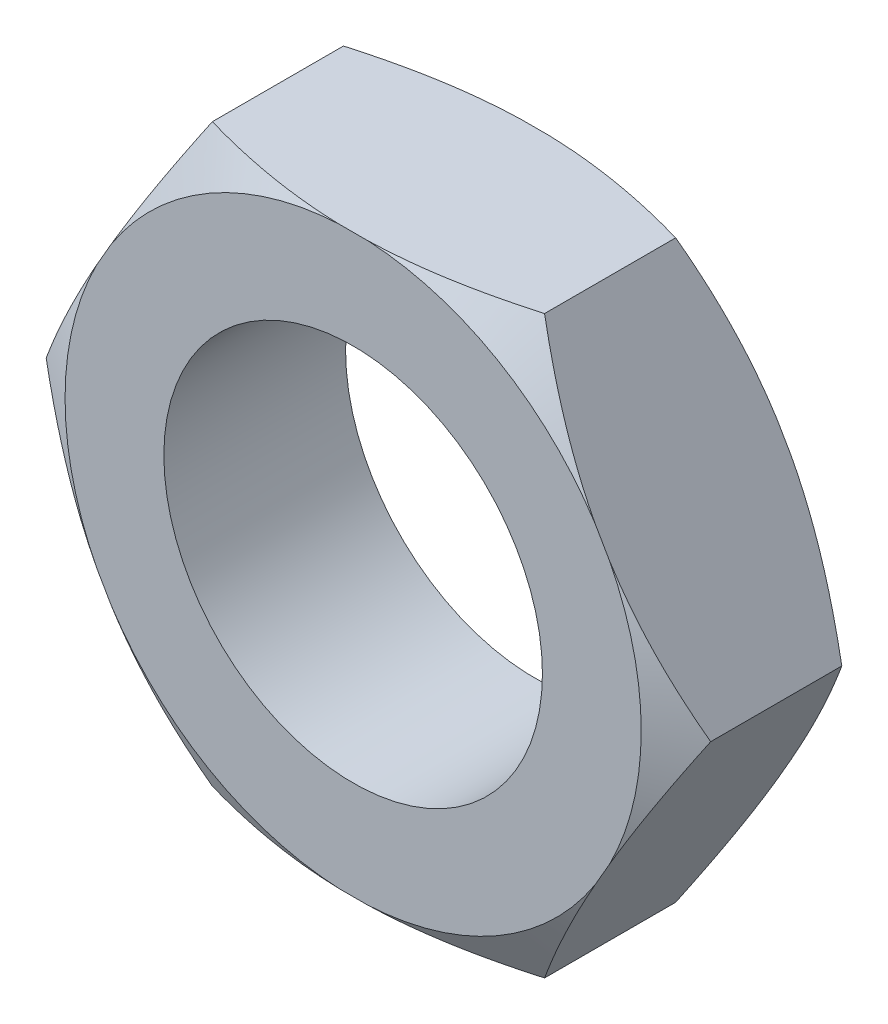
ISO-10303-21;
HEADER;
FILE_DESCRIPTION(('STEP AP214'),'2;1');
FILE_NAME('part.step','',(''),(''),'','','');
FILE_SCHEMA(('AUTOMOTIVE_DESIGN { 1 0 10303 214 1 1 1 1 }'));
ENDSEC;
DATA;
#1=APPLICATION_CONTEXT('core data for automotive mechanical design processes');
#2=APPLICATION_PROTOCOL_DEFINITION('international standard','automotive_design',2000,#1);
#3=PRODUCT_CONTEXT('',#1,'mechanical');
#4=PRODUCT('Part','Part','',(#3));
#5=PRODUCT_RELATED_PRODUCT_CATEGORY('part','',(#4));
#6=PRODUCT_DEFINITION_FORMATION('','',#4);
#7=PRODUCT_DEFINITION_CONTEXT('part definition',#1,'design');
#8=PRODUCT_DEFINITION('design','',#6,#7);
#9=PRODUCT_DEFINITION_SHAPE('','',#8);
#10=(LENGTH_UNIT() NAMED_UNIT(*) SI_UNIT(.MILLI.,.METRE.));
#11=(NAMED_UNIT(*) PLANE_ANGLE_UNIT() SI_UNIT($,.RADIAN.));
#12=(NAMED_UNIT(*) SI_UNIT($,.STERADIAN.) SOLID_ANGLE_UNIT());
#13=UNCERTAINTY_MEASURE_WITH_UNIT(LENGTH_MEASURE(1.E-05),#10,'distance_accuracy_value','');
#14=(GEOMETRIC_REPRESENTATION_CONTEXT(3) GLOBAL_UNCERTAINTY_ASSIGNED_CONTEXT((#13)) GLOBAL_UNIT_ASSIGNED_CONTEXT((#10,
#11,#12)) REPRESENTATION_CONTEXT('',''));
#15=CARTESIAN_POINT('',(0.,0.,0.));
#16=DIRECTION('',(0.,0.,1.));
#17=DIRECTION('',(1.,0.,0.));
#18=AXIS2_PLACEMENT_3D('',#15,#16,#17);
#19=CARTESIAN_POINT('',(-4.1794385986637,-7.239,2.286));
#20=DIRECTION('',(0.,1.,0.));
#21=DIRECTION('',(-1.,0.,0.));
#22=AXIS2_PLACEMENT_3D('',#19,#20,#21);
#23=PLANE('',#22);
#24=CARTESIAN_POINT('',(-9.20947754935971,-7.239,-0.27212653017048));
#25=CARTESIAN_POINT('',(-8.94653949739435,-7.239,-0.153751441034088));
#26=CARTESIAN_POINT('',(-8.68288827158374,-7.239,-0.0369299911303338));
#27=CARTESIAN_POINT('',(-8.15385244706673,-7.239,0.192848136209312));
#28=CARTESIAN_POINT('',(-7.88846754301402,-7.239,0.30580410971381));
#29=CARTESIAN_POINT('',(-7.35463378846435,-7.239,0.527514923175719));
#30=CARTESIAN_POINT('',(-7.08617675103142,-7.239,0.636250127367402));
#31=CARTESIAN_POINT('',(-6.54700946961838,-7.239,0.847968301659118));
#32=CARTESIAN_POINT('',(-6.27629933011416,-7.239,0.950951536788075));
#33=CARTESIAN_POINT('',(-5.73361513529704,-7.239,1.14939780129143));
#34=CARTESIAN_POINT('',(-5.46165362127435,-7.239,1.24489495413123));
#35=CARTESIAN_POINT('',(-4.91484638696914,-7.239,1.42734966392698));
#36=CARTESIAN_POINT('',(-4.64000052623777,-7.239,1.51430680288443));
#37=CARTESIAN_POINT('',(-4.08757525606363,-7.239,1.67765998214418));
#38=CARTESIAN_POINT('',(-3.81000012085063,-7.239,1.7540703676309));
#39=CARTESIAN_POINT('',(-3.25164692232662,-7.239,1.89426943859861));
#40=CARTESIAN_POINT('',(-2.97086899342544,-7.239,1.95805865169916));
#41=CARTESIAN_POINT('',(-2.48496060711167,-7.239,2.05496096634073));
#42=CARTESIAN_POINT('',(-2.28054691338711,-7.239,2.09166931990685));
#43=CARTESIAN_POINT('',(-1.87037228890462,-7.239,2.15641835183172));
#44=CARTESIAN_POINT('',(-1.66461158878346,-7.239,2.18446047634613));
#45=CARTESIAN_POINT('',(-1.25205699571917,-7.239,2.23112652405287));
#46=CARTESIAN_POINT('',(-1.0452633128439,-7.239,2.2497522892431));
#47=CARTESIAN_POINT('',(-0.631013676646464,-7.239,2.27704143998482));
#48=CARTESIAN_POINT('',(-0.423557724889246,-7.239,2.28570484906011));
#49=CARTESIAN_POINT('',(-0.00855284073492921,-7.239,2.29279475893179));
#50=CARTESIAN_POINT('',(0.19899602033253,-7.239,2.29122539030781));
#51=CARTESIAN_POINT('',(0.61376223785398,-7.239,2.27791016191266));
#52=CARTESIAN_POINT('',(0.82097959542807,-7.239,2.26616433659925));
#53=CARTESIAN_POINT('',(1.23463556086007,-7.239,2.2328579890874));
#54=CARTESIAN_POINT('',(1.44107410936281,-7.239,2.21129673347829));
#55=CARTESIAN_POINT('',(1.85279820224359,-7.239,2.15898372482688));
#56=CARTESIAN_POINT('',(2.05808353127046,-7.239,2.12823030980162));
#57=CARTESIAN_POINT('',(2.86373569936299,-7.239,1.9905481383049));
#58=CARTESIAN_POINT('',(3.45875792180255,-7.239,1.85149583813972));
#59=CARTESIAN_POINT('',(4.34057062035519,-7.239,1.60508442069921));
#60=CARTESIAN_POINT('',(4.63307259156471,-7.239,1.51651019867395));
#61=CARTESIAN_POINT('',(5.21479751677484,-7.239,1.32910372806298));
#62=CARTESIAN_POINT('',(5.50402068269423,-7.239,1.2302721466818));
#63=CARTESIAN_POINT('',(6.08244707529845,-7.239,1.02329082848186));
#64=CARTESIAN_POINT('',(6.37161924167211,-7.239,0.91505539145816));
#65=CARTESIAN_POINT('',(6.94734111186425,-7.239,0.691789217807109));
#66=CARTESIAN_POINT('',(7.23389065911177,-7.239,0.576758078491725));
#67=CARTESIAN_POINT('',(7.80306676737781,-7.239,0.341898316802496));
#68=CARTESIAN_POINT('',(8.08570643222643,-7.239,0.222101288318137));
#69=CARTESIAN_POINT('',(8.6489914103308,-7.239,-0.0219232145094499));
#70=CARTESIAN_POINT('',(8.92963717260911,-7.239,-0.146149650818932));
#71=CARTESIAN_POINT('',(9.20947754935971,-7.239,-0.272126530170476));
#72=B_SPLINE_CURVE_WITH_KNOTS('',3,(#24,#25,#26,#27,#28,#29,#30,#31,#32,#33,#34,#35,#36,#37,#38,
#39,#40,#41,#42,#43,#44,#45,#46,#47,#48,#49,#50,#51,#52,#53,#54,#55,#56,#57,#58,#59,#60,#61,#62,
#63,#64,#65,#66,#67,#68,#69,#70,#71),.UNSPECIFIED.,.F.,.F.,(4,2,2,2,2,2,2,2,2,2,2,2,2,2,2,2,2,2,
2,2,2,2,2,4),(0.,0.865081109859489,1.73031892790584,2.59919048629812,3.46802197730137,
4.33262992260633,5.19728016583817,6.06074251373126,6.92416875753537,7.54705792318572,
8.16984308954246,8.79250638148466,9.41516820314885,10.0375786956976,10.6599870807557,
11.2824419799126,11.9050094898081,13.7341018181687,14.6508934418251,15.5676254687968,
16.4938260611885,17.4200815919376,18.3409801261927,19.2616642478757),.UNSPECIFIED.);
#73=CARTESIAN_POINT('',(-4.1794385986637,-7.239,1.64964364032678));
#74=VERTEX_POINT('',#73);
#75=CARTESIAN_POINT('',(-0.359015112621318,-7.239,2.286));
#76=VERTEX_POINT('',#75);
#77=EDGE_CURVE('E320',#74,#76,#72,.T.);
#78=ORIENTED_EDGE('',*,*,#77,.F.);
#79=DIRECTION('',(0.,0.,-1.));
#80=VECTOR('',#79,1.);
#81=CARTESIAN_POINT('',(-4.1794385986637,-7.239,2.286));
#82=LINE('',#81,#80);
#83=CARTESIAN_POINT('',(-4.1794385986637,-7.239,-1.64964364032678));
#84=VERTEX_POINT('',#83);
#85=EDGE_CURVE('E179',#74,#84,#82,.T.);
#86=ORIENTED_EDGE('',*,*,#85,.T.);
#87=CARTESIAN_POINT('',(9.20947754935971,-7.239,0.272126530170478));
#88=CARTESIAN_POINT('',(8.94653949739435,-7.239,0.153751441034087));
#89=CARTESIAN_POINT('',(8.68288827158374,-7.239,0.0369299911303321));
#90=CARTESIAN_POINT('',(8.15385244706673,-7.239,-0.192848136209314));
#91=CARTESIAN_POINT('',(7.88846754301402,-7.239,-0.305804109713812));
#92=CARTESIAN_POINT('',(7.35463378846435,-7.239,-0.527514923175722));
#93=CARTESIAN_POINT('',(7.08617675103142,-7.239,-0.636250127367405));
#94=CARTESIAN_POINT('',(6.54700946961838,-7.239,-0.847968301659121));
#95=CARTESIAN_POINT('',(6.27629933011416,-7.239,-0.950951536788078));
#96=CARTESIAN_POINT('',(5.73361513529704,-7.239,-1.14939780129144));
#97=CARTESIAN_POINT('',(5.46165362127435,-7.239,-1.24489495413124));
#98=CARTESIAN_POINT('',(4.91484638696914,-7.239,-1.42734966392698));
#99=CARTESIAN_POINT('',(4.64000052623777,-7.239,-1.51430680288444));
#100=CARTESIAN_POINT('',(4.08757525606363,-7.239,-1.67765998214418));
#101=CARTESIAN_POINT('',(3.81000012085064,-7.239,-1.7540703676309));
#102=CARTESIAN_POINT('',(3.25164692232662,-7.239,-1.89426943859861));
#103=CARTESIAN_POINT('',(2.97086899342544,-7.239,-1.95805865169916));
#104=CARTESIAN_POINT('',(2.48496060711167,-7.239,-2.05496096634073));
#105=CARTESIAN_POINT('',(2.28054691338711,-7.239,-2.09166931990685));
#106=CARTESIAN_POINT('',(1.87037228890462,-7.239,-2.15641835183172));
#107=CARTESIAN_POINT('',(1.66461158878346,-7.239,-2.18446047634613));
#108=CARTESIAN_POINT('',(1.25205699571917,-7.239,-2.23112652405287));
#109=CARTESIAN_POINT('',(1.04526331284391,-7.239,-2.2497522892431));
#110=CARTESIAN_POINT('',(0.631013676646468,-7.239,-2.27704143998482));
#111=CARTESIAN_POINT('',(0.42355772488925,-7.239,-2.28570484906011));
#112=CARTESIAN_POINT('',(0.00855284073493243,-7.239,-2.29279475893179));
#113=CARTESIAN_POINT('',(-0.198996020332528,-7.239,-2.29122539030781));
#114=CARTESIAN_POINT('',(-0.613762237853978,-7.239,-2.27791016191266));
#115=CARTESIAN_POINT('',(-0.820979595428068,-7.239,-2.26616433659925));
#116=CARTESIAN_POINT('',(-1.23463556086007,-7.239,-2.2328579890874));
#117=CARTESIAN_POINT('',(-1.44107410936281,-7.239,-2.21129673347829));
#118=CARTESIAN_POINT('',(-1.85279820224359,-7.239,-2.15898372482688));
#119=CARTESIAN_POINT('',(-2.05808353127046,-7.239,-2.12823030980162));
#120=CARTESIAN_POINT('',(-2.86373569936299,-7.239,-1.9905481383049));
#121=CARTESIAN_POINT('',(-3.45875792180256,-7.239,-1.85149583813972));
#122=CARTESIAN_POINT('',(-4.34057062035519,-7.239,-1.60508442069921));
#123=CARTESIAN_POINT('',(-4.63307259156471,-7.239,-1.51651019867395));
#124=CARTESIAN_POINT('',(-5.21479751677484,-7.239,-1.32910372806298));
#125=CARTESIAN_POINT('',(-5.50402068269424,-7.239,-1.23027214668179));
#126=CARTESIAN_POINT('',(-6.08244707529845,-7.239,-1.02329082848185));
#127=CARTESIAN_POINT('',(-6.37161924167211,-7.239,-0.915055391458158));
#128=CARTESIAN_POINT('',(-6.94734111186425,-7.239,-0.691789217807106));
#129=CARTESIAN_POINT('',(-7.23389065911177,-7.239,-0.576758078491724));
#130=CARTESIAN_POINT('',(-7.80306676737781,-7.239,-0.341898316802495));
#131=CARTESIAN_POINT('',(-8.08570643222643,-7.239,-0.222101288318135));
#132=CARTESIAN_POINT('',(-8.6489914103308,-7.239,0.0219232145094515));
#133=CARTESIAN_POINT('',(-8.92963717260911,-7.239,0.146149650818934));
#134=CARTESIAN_POINT('',(-9.20947754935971,-7.239,0.272126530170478));
#135=B_SPLINE_CURVE_WITH_KNOTS('',3,(#87,#88,#89,#90,#91,#92,#93,#94,#95,#96,#97,#98,#99,#100,
#101,#102,#103,#104,#105,#106,#107,#108,#109,#110,#111,#112,#113,#114,#115,#116,#117,#118,#119,
#120,#121,#122,#123,#124,#125,#126,#127,#128,#129,#130,#131,#132,#133,#134),.UNSPECIFIED.,.F.,
.F.,(4,2,2,2,2,2,2,2,2,2,2,2,2,2,2,2,2,2,2,2,2,2,2,4),(0.,0.865081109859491,1.73031892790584,
2.59919048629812,3.46802197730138,4.33262992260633,5.19728016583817,6.06074251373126,
6.92416875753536,7.54705792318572,8.16984308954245,8.79250638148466,9.41516820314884,
10.0375786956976,10.6599870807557,11.2824419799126,11.9050094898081,13.7341018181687,
14.6508934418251,15.5676254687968,16.4938260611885,17.4200815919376,18.3409801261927,
19.2616642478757),.UNSPECIFIED.);
#136=CARTESIAN_POINT('',(-0.359015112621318,-7.239,-2.286));
#137=VERTEX_POINT('',#136);
#138=EDGE_CURVE('E252',#137,#84,#135,.T.);
#139=ORIENTED_EDGE('',*,*,#138,.F.);
#140=DIRECTION('',(1.,0.,0.));
#141=VECTOR('',#140,1.);
#142=CARTESIAN_POINT('',(-4.1794385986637,-7.239,-2.286));
#143=LINE('',#142,#141);
#144=CARTESIAN_POINT('',(0.359015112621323,-7.239,-2.286));
#145=VERTEX_POINT('',#144);
#146=EDGE_CURVE('E185',#137,#145,#143,.T.);
#147=ORIENTED_EDGE('',*,*,#146,.T.);
#148=CARTESIAN_POINT('',(4.1794385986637,-7.239,-1.64964364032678));
#149=VERTEX_POINT('',#148);
#150=EDGE_CURVE('E340',#149,#145,#135,.T.);
#151=ORIENTED_EDGE('',*,*,#150,.F.);
#152=DIRECTION('',(0.,0.,-1.));
#153=VECTOR('',#152,1.);
#154=CARTESIAN_POINT('',(4.1794385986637,-7.239,2.286));
#155=LINE('',#154,#153);
#156=CARTESIAN_POINT('',(4.1794385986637,-7.239,1.64964364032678));
#157=VERTEX_POINT('',#156);
#158=EDGE_CURVE('E213',#157,#149,#155,.T.);
#159=ORIENTED_EDGE('',*,*,#158,.F.);
#160=CARTESIAN_POINT('',(0.359015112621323,-7.239,2.286));
#161=VERTEX_POINT('',#160);
#162=EDGE_CURVE('E312',#161,#157,#72,.T.);
#163=ORIENTED_EDGE('',*,*,#162,.F.);
#164=DIRECTION('',(1.,0.,0.));
#165=VECTOR('',#164,1.);
#166=CARTESIAN_POINT('',(-4.1794385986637,-7.239,2.286));
#167=LINE('',#166,#165);
#168=EDGE_CURVE('E204',#76,#161,#167,.T.);
#169=ORIENTED_EDGE('',*,*,#168,.F.);
#170=EDGE_LOOP('',(#78,#86,#139,#147,#151,#159,#163,#169));
#171=FACE_BOUND('',#170,.T.);
#172=ADVANCED_FACE('F35',(#171),#23,.F.);
#173=CARTESIAN_POINT('',(4.1794385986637,-7.239,2.286));
#174=DIRECTION('',(-0.866025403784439,0.5,0.));
#175=DIRECTION('',(-0.5,-0.866025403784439,0.));
#176=AXIS2_PLACEMENT_3D('',#173,#174,#175);
#177=PLANE('',#176);
#178=CARTESIAN_POINT('',(1.27534425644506,-12.269038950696,-0.627916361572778));
#179=CARTESIAN_POINT('',(1.4075419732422,-12.0400657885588,-0.505321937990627));
#180=CARTESIAN_POINT('',(1.5400537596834,-11.8105486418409,-0.384061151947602));
#181=CARTESIAN_POINT('',(1.80583886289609,-11.3501953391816,-0.144837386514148));
#182=CARTESIAN_POINT('',(1.9391122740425,-11.119359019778,-0.0268748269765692));
#183=CARTESIAN_POINT('',(2.20695466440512,-10.6554423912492,0.205467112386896));
#184=CARTESIAN_POINT('',(2.34152644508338,-10.4223572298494,0.319833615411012));
#185=CARTESIAN_POINT('',(2.61167316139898,-9.95444939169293,0.543714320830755));
#186=CARTESIAN_POINT('',(2.74724806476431,-9.71962677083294,0.653228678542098));
#187=CARTESIAN_POINT('',(3.02289958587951,-9.24218433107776,0.868948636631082));
#188=CARTESIAN_POINT('',(3.16300508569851,-8.99951448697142,0.975007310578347));
#189=CARTESIAN_POINT('',(3.44462156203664,-8.51174044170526,1.17946159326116));
#190=CARTESIAN_POINT('',(3.58613260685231,-8.26663612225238,1.27785682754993));
#191=CARTESIAN_POINT('',(3.87058997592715,-7.77394150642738,1.46507800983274));
#192=CARTESIAN_POINT('',(4.01353475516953,-7.52635388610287,1.55391325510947));
#193=CARTESIAN_POINT('',(4.30108870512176,-7.02829583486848,1.71992562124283));
#194=CARTESIAN_POINT('',(4.44569765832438,-6.77782578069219,1.79710424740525));
#195=CARTESIAN_POINT('',(4.79244935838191,-6.17723421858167,1.96415737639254));
#196=CARTESIAN_POINT('',(4.99540532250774,-5.8257041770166,2.04756470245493));
#197=CARTESIAN_POINT('',(5.3018708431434,-5.29489032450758,2.14705333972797));
#198=CARTESIAN_POINT('',(5.40435888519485,-5.11737582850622,2.17594493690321));
#199=CARTESIAN_POINT('',(5.6098911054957,-4.7613835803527,2.22444965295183));
#200=CARTESIAN_POINT('',(5.71293527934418,-4.58290583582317,2.24406284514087));
#201=CARTESIAN_POINT('',(5.91820407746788,-4.22736984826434,2.27326557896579));
#202=CARTESIAN_POINT('',(6.02042472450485,-4.05031849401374,2.28296639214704));
#203=CARTESIAN_POINT('',(6.22498077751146,-3.69601701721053,2.29244005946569));
#204=CARTESIAN_POINT('',(6.32731618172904,-3.5187668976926,2.29221306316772));
#205=CARTESIAN_POINT('',(6.53186812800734,-3.16447253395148,2.28183680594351));
#206=CARTESIAN_POINT('',(6.63408466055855,-2.98742830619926,2.27168679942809));
#207=CARTESIAN_POINT('',(6.83816458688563,-2.63395150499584,2.24177474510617));
#208=CARTESIAN_POINT('',(6.94002796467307,-2.45751895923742,2.22201226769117));
#209=CARTESIAN_POINT('',(7.18291293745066,-2.03682984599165,2.16393407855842));
#210=CARTESIAN_POINT('',(7.32368342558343,-1.79300820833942,2.12138620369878));
#211=CARTESIAN_POINT('',(7.60383400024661,-1.30777317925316,2.02080883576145));
#212=CARTESIAN_POINT('',(7.74321383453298,-1.06636022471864,1.96277658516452));
#213=CARTESIAN_POINT('',(8.02056750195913,-0.585969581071,1.83346901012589));
#214=CARTESIAN_POINT('',(8.15853970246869,-0.346994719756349,1.7621798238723));
#215=CARTESIAN_POINT('',(8.43292724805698,0.128258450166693,1.60861757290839));
#216=CARTESIAN_POINT('',(8.56934264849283,0.364536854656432,1.52634490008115));
#217=CARTESIAN_POINT('',(8.84224181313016,0.837212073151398,1.35179807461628));
#218=CARTESIAN_POINT('',(8.97870917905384,1.0735804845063,1.25942208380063));
#219=CARTESIAN_POINT('',(9.25030414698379,1.54399676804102,1.06713652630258));
#220=CARTESIAN_POINT('',(9.3854317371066,1.77804461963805,0.967226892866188));
#221=CARTESIAN_POINT('',(9.65443065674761,2.24396441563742,0.761314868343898));
#222=CARTESIAN_POINT('',(9.78830263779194,2.47583748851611,0.655315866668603));
#223=CARTESIAN_POINT('',(10.0550167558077,2.93779989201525,0.438287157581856));
#224=CARTESIAN_POINT('',(10.1878589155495,3.16788926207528,0.327257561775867));
#225=CARTESIAN_POINT('',(10.3997475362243,3.53489111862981,0.146245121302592));
#226=CARTESIAN_POINT('',(10.4790786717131,3.67229667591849,0.077589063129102));
#227=CARTESIAN_POINT('',(10.6374460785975,3.94659707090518,-0.0610609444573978));
#228=CARTESIAN_POINT('',(10.7164823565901,4.08349192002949,-0.131054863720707));
#229=CARTESIAN_POINT('',(10.8735639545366,4.35556522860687,-0.271593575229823));
#230=CARTESIAN_POINT('',(10.9516117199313,4.49074792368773,-0.342127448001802));
#231=CARTESIAN_POINT('',(11.1074667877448,4.76069681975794,-0.484255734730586));
#232=CARTESIAN_POINT('',(11.1852740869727,4.89546301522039,-0.555850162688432));
#233=CARTESIAN_POINT('',(11.262971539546,5.03003895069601,-0.627916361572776));
#234=B_SPLINE_CURVE_WITH_KNOTS('',3,(#178,#179,#180,#181,#182,#183,#184,#185,#186,#187,#188,
#189,#190,#191,#192,#193,#194,#195,#196,#197,#198,#199,#200,#201,#202,#203,#204,#205,#206,#207,
#208,#209,#210,#211,#212,#213,#214,#215,#216,#217,#218,#219,#220,#221,#222,#223,#224,#225,#226,
#227,#228,#229,#230,#231,#232,#233),.UNSPECIFIED.,.F.,.F.,(4,2,2,2,2,2,2,2,2,2,2,2,2,2,2,2,2,2,
2,2,2,2,2,2,2,2,2,4),(0.,0.874314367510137,1.74873953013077,2.62600365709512,3.50323968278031,
4.40198071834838,5.30076564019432,6.19866842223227,7.0964551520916,8.33825741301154,
8.95908984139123,9.57991736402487,10.1936965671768,10.807466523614,11.4212826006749,
12.0351261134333,12.8888155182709,13.742657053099,14.5973964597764,15.4521053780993,
16.3164019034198,17.1807060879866,18.0445337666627,18.9083422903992,19.4269757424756,
19.9455975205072,20.459468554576,20.9733463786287),.UNSPECIFIED.);
#235=CARTESIAN_POINT('',(6.08965034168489,-3.93041620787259,2.286));
#236=VERTEX_POINT('',#235);
#237=EDGE_CURVE('E308',#157,#236,#234,.T.);
#238=ORIENTED_EDGE('',*,*,#237,.F.);
#239=ORIENTED_EDGE('',*,*,#158,.T.);
#240=CARTESIAN_POINT('',(11.262971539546,5.03003895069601,0.627916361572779));
#241=CARTESIAN_POINT('',(11.1307738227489,4.80106578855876,0.505321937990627));
#242=CARTESIAN_POINT('',(10.9982620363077,4.57154864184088,0.384061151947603));
#243=CARTESIAN_POINT('',(10.732476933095,4.11119533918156,0.144837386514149));
#244=CARTESIAN_POINT('',(10.5992035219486,3.88035901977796,0.0268748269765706));
#245=CARTESIAN_POINT('',(10.331361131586,3.41644239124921,-0.205467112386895));
#246=CARTESIAN_POINT('',(10.1967893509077,3.18335722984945,-0.319833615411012));
#247=CARTESIAN_POINT('',(9.92664263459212,2.71544939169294,-0.543714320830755));
#248=CARTESIAN_POINT('',(9.79106773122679,2.48062677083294,-0.653228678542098));
#249=CARTESIAN_POINT('',(9.51541621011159,2.00318433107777,-0.868948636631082));
#250=CARTESIAN_POINT('',(9.37531071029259,1.76051448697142,-0.975007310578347));
#251=CARTESIAN_POINT('',(9.09369423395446,1.27274044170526,-1.17946159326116));
#252=CARTESIAN_POINT('',(8.9521831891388,1.02763612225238,-1.27785682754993));
#253=CARTESIAN_POINT('',(8.66772582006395,0.534941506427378,-1.46507800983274));
#254=CARTESIAN_POINT('',(8.52478104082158,0.287353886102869,-1.55391325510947));
#255=CARTESIAN_POINT('',(8.23722709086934,-0.210704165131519,-1.71992562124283));
#256=CARTESIAN_POINT('',(8.09261813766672,-0.461174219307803,-1.79710424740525));
#257=CARTESIAN_POINT('',(7.74586643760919,-1.06176578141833,-1.96415737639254));
#258=CARTESIAN_POINT('',(7.54291047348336,-1.4132958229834,-2.04756470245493));
#259=CARTESIAN_POINT('',(7.2364449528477,-1.94410967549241,-2.14705333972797));
#260=CARTESIAN_POINT('',(7.13395691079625,-2.12162417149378,-2.17594493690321));
#261=CARTESIAN_POINT('',(6.9284246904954,-2.47761641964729,-2.22444965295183));
#262=CARTESIAN_POINT('',(6.82538051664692,-2.65609416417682,-2.24406284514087));
#263=CARTESIAN_POINT('',(6.62011171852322,-3.01163015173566,-2.27326557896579));
#264=CARTESIAN_POINT('',(6.51789107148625,-3.18868150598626,-2.28296639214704));
#265=CARTESIAN_POINT('',(6.31333501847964,-3.54298298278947,-2.29244005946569));
#266=CARTESIAN_POINT('',(6.21099961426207,-3.7202331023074,-2.29221306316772));
#267=CARTESIAN_POINT('',(6.00644766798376,-4.07452746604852,-2.28183680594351));
#268=CARTESIAN_POINT('',(5.90423113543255,-4.25157169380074,-2.27168679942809));
#269=CARTESIAN_POINT('',(5.70015120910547,-4.60504849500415,-2.24177474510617));
#270=CARTESIAN_POINT('',(5.59828783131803,-4.78148104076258,-2.22201226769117));
#271=CARTESIAN_POINT('',(5.35540285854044,-5.20217015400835,-2.16393407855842));
#272=CARTESIAN_POINT('',(5.21463237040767,-5.44599179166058,-2.12138620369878));
#273=CARTESIAN_POINT('',(4.93448179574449,-5.93122682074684,-2.02080883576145));
#274=CARTESIAN_POINT('',(4.79510196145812,-6.17263977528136,-1.96277658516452));
#275=CARTESIAN_POINT('',(4.51774829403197,-6.653030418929,-1.83346901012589));
#276=CARTESIAN_POINT('',(4.37977609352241,-6.89200528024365,-1.7621798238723));
#277=CARTESIAN_POINT('',(4.10538854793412,-7.36725845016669,-1.60861757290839));
#278=CARTESIAN_POINT('',(3.96897314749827,-7.60353685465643,-1.52634490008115));
#279=CARTESIAN_POINT('',(3.69607398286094,-8.0762120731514,-1.35179807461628));
#280=CARTESIAN_POINT('',(3.55960661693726,-8.3125804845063,-1.25942208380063));
#281=CARTESIAN_POINT('',(3.28801164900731,-8.78299676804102,-1.06713652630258));
#282=CARTESIAN_POINT('',(3.1528840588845,-9.01704461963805,-0.967226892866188));
#283=CARTESIAN_POINT('',(2.88388513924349,-9.48296441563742,-0.761314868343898));
#284=CARTESIAN_POINT('',(2.75001315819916,-9.71483748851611,-0.655315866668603));
#285=CARTESIAN_POINT('',(2.48329904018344,-10.1767998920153,-0.438287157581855));
#286=CARTESIAN_POINT('',(2.35045688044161,-10.4068892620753,-0.327257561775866));
#287=CARTESIAN_POINT('',(2.13856825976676,-10.7738911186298,-0.146245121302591));
#288=CARTESIAN_POINT('',(2.05923712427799,-10.9112966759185,-0.0775890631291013));
#289=CARTESIAN_POINT('',(1.9008697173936,-11.1855970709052,0.0610609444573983));
#290=CARTESIAN_POINT('',(1.82183343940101,-11.3224919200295,0.131054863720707));
#291=CARTESIAN_POINT('',(1.66475184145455,-11.5945652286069,0.271593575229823));
#292=CARTESIAN_POINT('',(1.58670407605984,-11.7297479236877,0.342127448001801));
#293=CARTESIAN_POINT('',(1.43084900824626,-11.9996968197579,0.484255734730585));
#294=CARTESIAN_POINT('',(1.35304170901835,-12.1344630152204,0.555850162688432));
#295=CARTESIAN_POINT('',(1.27534425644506,-12.269038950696,0.627916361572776));
#296=B_SPLINE_CURVE_WITH_KNOTS('',3,(#240,#241,#242,#243,#244,#245,#246,#247,#248,#249,#250,
#251,#252,#253,#254,#255,#256,#257,#258,#259,#260,#261,#262,#263,#264,#265,#266,#267,#268,#269,
#270,#271,#272,#273,#274,#275,#276,#277,#278,#279,#280,#281,#282,#283,#284,#285,#286,#287,#288,
#289,#290,#291,#292,#293,#294,#295),.UNSPECIFIED.,.F.,.F.,(4,2,2,2,2,2,2,2,2,2,2,2,2,2,2,2,2,2,
2,2,2,2,2,2,2,2,2,4),(0.,0.874314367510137,1.74873953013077,2.62600365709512,3.50323968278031,
4.40198071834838,5.30076564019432,6.19866842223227,7.0964551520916,8.33825741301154,
8.95908984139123,9.57991736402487,10.1936965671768,10.807466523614,11.4212826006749,
12.0351261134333,12.8888155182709,13.742657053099,14.5973964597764,15.4521053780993,
16.3164019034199,17.1807060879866,18.0445337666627,18.9083422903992,19.4269757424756,
19.9455975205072,20.459468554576,20.9733463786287),.UNSPECIFIED.);
#297=CARTESIAN_POINT('',(6.08965034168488,-3.93041620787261,-2.286));
#298=VERTEX_POINT('',#297);
#299=EDGE_CURVE('E347',#298,#149,#296,.T.);
#300=ORIENTED_EDGE('',*,*,#299,.F.);
#301=DIRECTION('',(0.5,0.866025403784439,0.));
#302=VECTOR('',#301,1.);
#303=CARTESIAN_POINT('',(4.1794385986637,-7.239,-2.286));
#304=LINE('',#303,#302);
#305=CARTESIAN_POINT('',(6.44866545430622,-3.30858379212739,-2.286));
#306=VERTEX_POINT('',#305);
#307=EDGE_CURVE('E188',#298,#306,#304,.T.);
#308=ORIENTED_EDGE('',*,*,#307,.T.);
#309=CARTESIAN_POINT('',(8.3588771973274,0.,-1.64964364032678));
#310=VERTEX_POINT('',#309);
#311=EDGE_CURVE('E273',#310,#306,#296,.T.);
#312=ORIENTED_EDGE('',*,*,#311,.F.);
#313=DIRECTION('',(0.,0.,-1.));
#314=VECTOR('',#313,1.);
#315=CARTESIAN_POINT('',(8.3588771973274,0.,2.286));
#316=LINE('',#315,#314);
#317=CARTESIAN_POINT('',(8.3588771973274,0.,1.64964364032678));
#318=VERTEX_POINT('',#317);
#319=EDGE_CURVE('E211',#318,#310,#316,.T.);
#320=ORIENTED_EDGE('',*,*,#319,.F.);
#321=CARTESIAN_POINT('',(6.44866545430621,-3.3085837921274,2.286));
#322=VERTEX_POINT('',#321);
#323=EDGE_CURVE('E303',#322,#318,#234,.T.);
#324=ORIENTED_EDGE('',*,*,#323,.F.);
#325=DIRECTION('',(0.5,0.866025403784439,0.));
#326=VECTOR('',#325,1.);
#327=CARTESIAN_POINT('',(4.1794385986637,-7.239,2.286));
#328=LINE('',#327,#326);
#329=EDGE_CURVE('E367',#236,#322,#328,.T.);
#330=ORIENTED_EDGE('',*,*,#329,.F.);
#331=EDGE_LOOP('',(#238,#239,#300,#308,#312,#320,#324,#330));
#332=FACE_BOUND('',#331,.T.);
#333=ADVANCED_FACE('F283',(#332),#177,.F.);
#334=CARTESIAN_POINT('',(8.3588771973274,0.,2.286));
#335=DIRECTION('',(-0.866025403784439,-0.5,0.));
#336=DIRECTION('',(0.5,-0.866025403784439,0.));
#337=AXIS2_PLACEMENT_3D('',#334,#335,#336);
#338=PLANE('',#337);
#339=CARTESIAN_POINT('',(11.262971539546,-5.03003895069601,-0.627916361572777));
#340=CARTESIAN_POINT('',(11.1307738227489,-4.80106578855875,-0.505321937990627));
#341=CARTESIAN_POINT('',(10.9982620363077,-4.57154864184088,-0.384061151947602));
#342=CARTESIAN_POINT('',(10.732476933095,-4.11119533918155,-0.144837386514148));
#343=CARTESIAN_POINT('',(10.5992035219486,-3.88035901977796,-0.0268748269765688));
#344=CARTESIAN_POINT('',(10.331361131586,-3.4164423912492,0.205467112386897));
#345=CARTESIAN_POINT('',(10.1967893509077,-3.18335722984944,0.319833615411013));
#346=CARTESIAN_POINT('',(9.92664263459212,-2.71544939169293,0.543714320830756));
#347=CARTESIAN_POINT('',(9.79106773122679,-2.48062677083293,0.653228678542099));
#348=CARTESIAN_POINT('',(9.51541621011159,-2.00318433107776,0.868948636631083));
#349=CARTESIAN_POINT('',(9.37531071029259,-1.76051448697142,0.975007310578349));
#350=CARTESIAN_POINT('',(9.09369423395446,-1.27274044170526,1.17946159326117));
#351=CARTESIAN_POINT('',(8.9521831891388,-1.02763612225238,1.27785682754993));
#352=CARTESIAN_POINT('',(8.66772582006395,-0.534941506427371,1.46507800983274));
#353=CARTESIAN_POINT('',(8.52478104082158,-0.287353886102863,1.55391325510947));
#354=CARTESIAN_POINT('',(8.23722709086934,0.210704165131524,1.71992562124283));
#355=CARTESIAN_POINT('',(8.09261813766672,0.461174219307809,1.79710424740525));
#356=CARTESIAN_POINT('',(7.74586643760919,1.06176578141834,1.96415737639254));
#357=CARTESIAN_POINT('',(7.54291047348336,1.4132958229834,2.04756470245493));
#358=CARTESIAN_POINT('',(7.2364449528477,1.94410967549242,2.14705333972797));
#359=CARTESIAN_POINT('',(7.13395691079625,2.12162417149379,2.17594493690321));
#360=CARTESIAN_POINT('',(6.9284246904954,2.4776164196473,2.22444965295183));
#361=CARTESIAN_POINT('',(6.82538051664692,2.65609416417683,2.24406284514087));
#362=CARTESIAN_POINT('',(6.62011171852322,3.01163015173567,2.27326557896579));
#363=CARTESIAN_POINT('',(6.51789107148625,3.18868150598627,2.28296639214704));
#364=CARTESIAN_POINT('',(6.31333501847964,3.54298298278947,2.29244005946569));
#365=CARTESIAN_POINT('',(6.21099961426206,3.72023310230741,2.29221306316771));
#366=CARTESIAN_POINT('',(6.00644766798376,4.07452746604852,2.28183680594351));
#367=CARTESIAN_POINT('',(5.90423113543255,4.25157169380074,2.27168679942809));
#368=CARTESIAN_POINT('',(5.70015120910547,4.60504849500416,2.24177474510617));
#369=CARTESIAN_POINT('',(5.59828783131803,4.78148104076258,2.22201226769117));
#370=CARTESIAN_POINT('',(5.35540285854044,5.20217015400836,2.16393407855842));
#371=CARTESIAN_POINT('',(5.21463237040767,5.44599179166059,2.12138620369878));
#372=CARTESIAN_POINT('',(4.93448179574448,5.93122682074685,2.02080883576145));
#373=CARTESIAN_POINT('',(4.79510196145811,6.17263977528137,1.96277658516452));
#374=CARTESIAN_POINT('',(4.51774829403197,6.65303041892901,1.83346901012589));
#375=CARTESIAN_POINT('',(4.3797760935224,6.89200528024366,1.7621798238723));
#376=CARTESIAN_POINT('',(4.10538854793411,7.3672584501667,1.60861757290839));
#377=CARTESIAN_POINT('',(3.96897314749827,7.60353685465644,1.52634490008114));
#378=CARTESIAN_POINT('',(3.69607398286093,8.07621207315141,1.35179807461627));
#379=CARTESIAN_POINT('',(3.55960661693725,8.31258048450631,1.25942208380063));
#380=CARTESIAN_POINT('',(3.2880116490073,8.78299676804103,1.06713652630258));
#381=CARTESIAN_POINT('',(3.1528840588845,9.01704461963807,0.967226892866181));
#382=CARTESIAN_POINT('',(2.88388513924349,9.48296441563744,0.76131486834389));
#383=CARTESIAN_POINT('',(2.75001315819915,9.71483748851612,0.655315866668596));
#384=CARTESIAN_POINT('',(2.48329904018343,10.1767998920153,0.438287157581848));
#385=CARTESIAN_POINT('',(2.3504568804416,10.4068892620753,0.327257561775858));
#386=CARTESIAN_POINT('',(2.13856825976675,10.7738911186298,0.146245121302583));
#387=CARTESIAN_POINT('',(2.05923712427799,10.9112966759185,0.0775890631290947));
#388=CARTESIAN_POINT('',(1.9008697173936,11.1855970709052,-0.0610609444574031));
#389=CARTESIAN_POINT('',(1.82183343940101,11.3224919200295,-0.131054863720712));
#390=CARTESIAN_POINT('',(1.66475184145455,11.5945652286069,-0.271593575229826));
#391=CARTESIAN_POINT('',(1.58670407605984,11.7297479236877,-0.342127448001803));
#392=CARTESIAN_POINT('',(1.43084900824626,11.9996968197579,-0.484255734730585));
#393=CARTESIAN_POINT('',(1.35304170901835,12.1344630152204,-0.555850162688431));
#394=CARTESIAN_POINT('',(1.27534425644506,12.269038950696,-0.627916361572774));
#395=B_SPLINE_CURVE_WITH_KNOTS('',3,(#339,#340,#341,#342,#343,#344,#345,#346,#347,#348,#349,
#350,#351,#352,#353,#354,#355,#356,#357,#358,#359,#360,#361,#362,#363,#364,#365,#366,#367,#368,
#369,#370,#371,#372,#373,#374,#375,#376,#377,#378,#379,#380,#381,#382,#383,#384,#385,#386,#387,
#388,#389,#390,#391,#392,#393,#394),.UNSPECIFIED.,.F.,.F.,(4,2,2,2,2,2,2,2,2,2,2,2,2,2,2,2,2,2,
2,2,2,2,2,2,2,2,2,4),(0.,0.874314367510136,1.74873953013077,2.62600365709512,3.50323968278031,
4.40198071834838,5.30076564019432,6.19866842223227,7.0964551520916,8.33825741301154,
8.95908984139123,9.57991736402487,10.1936965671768,10.807466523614,11.4212826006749,
12.0351261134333,12.8888155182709,13.742657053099,14.5973964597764,15.4521053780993,
16.3164019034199,17.1807060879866,18.0445337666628,18.9083422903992,19.4269757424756,
19.9455975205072,20.459468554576,20.9733463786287),.UNSPECIFIED.);
#396=CARTESIAN_POINT('',(6.44866545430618,3.30858379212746,2.286));
#397=VERTEX_POINT('',#396);
#398=EDGE_CURVE('E296',#318,#397,#395,.T.);
#399=ORIENTED_EDGE('',*,*,#398,.F.);
#400=ORIENTED_EDGE('',*,*,#319,.T.);
#401=CARTESIAN_POINT('',(1.27534425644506,12.269038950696,0.627916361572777));
#402=CARTESIAN_POINT('',(1.4075419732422,12.0400657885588,0.505321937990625));
#403=CARTESIAN_POINT('',(1.5400537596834,11.8105486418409,0.3840611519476));
#404=CARTESIAN_POINT('',(1.8058388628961,11.3501953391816,0.144837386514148));
#405=CARTESIAN_POINT('',(1.93911227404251,11.119359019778,0.0268748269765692));
#406=CARTESIAN_POINT('',(2.20695466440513,10.6554423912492,-0.205467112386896));
#407=CARTESIAN_POINT('',(2.34152644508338,10.4223572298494,-0.319833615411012));
#408=CARTESIAN_POINT('',(2.61167316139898,9.95444939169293,-0.543714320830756));
#409=CARTESIAN_POINT('',(2.74724806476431,9.71962677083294,-0.653228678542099));
#410=CARTESIAN_POINT('',(3.02289958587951,9.24218433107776,-0.868948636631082));
#411=CARTESIAN_POINT('',(3.16300508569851,8.99951448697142,-0.975007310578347));
#412=CARTESIAN_POINT('',(3.44462156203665,8.51174044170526,-1.17946159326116));
#413=CARTESIAN_POINT('',(3.58613260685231,8.26663612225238,-1.27785682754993));
#414=CARTESIAN_POINT('',(3.87058997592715,7.77394150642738,-1.46507800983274));
#415=CARTESIAN_POINT('',(4.01353475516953,7.52635388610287,-1.55391325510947));
#416=CARTESIAN_POINT('',(4.30108870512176,7.02829583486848,-1.71992562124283));
#417=CARTESIAN_POINT('',(4.44569765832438,6.77782578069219,-1.79710424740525));
#418=CARTESIAN_POINT('',(4.79244935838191,6.17723421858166,-1.96415737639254));
#419=CARTESIAN_POINT('',(4.99540532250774,5.8257041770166,-2.04756470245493));
#420=CARTESIAN_POINT('',(5.3018708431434,5.29489032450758,-2.14705333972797));
#421=CARTESIAN_POINT('',(5.40435888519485,5.11737582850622,-2.17594493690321));
#422=CARTESIAN_POINT('',(5.60989110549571,4.7613835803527,-2.22444965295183));
#423=CARTESIAN_POINT('',(5.71293527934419,4.58290583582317,-2.24406284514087));
#424=CARTESIAN_POINT('',(5.91820407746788,4.22736984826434,-2.27326557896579));
#425=CARTESIAN_POINT('',(6.02042472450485,4.05031849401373,-2.28296639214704));
#426=CARTESIAN_POINT('',(6.22498077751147,3.69601701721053,-2.29244005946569));
#427=CARTESIAN_POINT('',(6.32731618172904,3.5187668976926,-2.29221306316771));
#428=CARTESIAN_POINT('',(6.53186812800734,3.16447253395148,-2.28183680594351));
#429=CARTESIAN_POINT('',(6.63408466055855,2.98742830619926,-2.27168679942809));
#430=CARTESIAN_POINT('',(6.83816458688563,2.63395150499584,-2.24177474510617));
#431=CARTESIAN_POINT('',(6.94002796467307,2.45751895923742,-2.22201226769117));
#432=CARTESIAN_POINT('',(7.18291293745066,2.03682984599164,-2.16393407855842));
#433=CARTESIAN_POINT('',(7.32368342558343,1.79300820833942,-2.12138620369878));
#434=CARTESIAN_POINT('',(7.60383400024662,1.30777317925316,-2.02080883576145));
#435=CARTESIAN_POINT('',(7.74321383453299,1.06636022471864,-1.96277658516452));
#436=CARTESIAN_POINT('',(8.02056750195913,0.585969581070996,-1.83346901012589));
#437=CARTESIAN_POINT('',(8.1585397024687,0.346994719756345,-1.7621798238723));
#438=CARTESIAN_POINT('',(8.43292724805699,-0.128258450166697,-1.60861757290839));
#439=CARTESIAN_POINT('',(8.56934264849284,-0.364536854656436,-1.52634490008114));
#440=CARTESIAN_POINT('',(8.84224181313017,-0.837212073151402,-1.35179807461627));
#441=CARTESIAN_POINT('',(8.97870917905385,-1.07358048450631,-1.25942208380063));
#442=CARTESIAN_POINT('',(9.2503041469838,-1.54399676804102,-1.06713652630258));
#443=CARTESIAN_POINT('',(9.3854317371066,-1.77804461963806,-0.967226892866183));
#444=CARTESIAN_POINT('',(9.65443065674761,-2.24396441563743,-0.761314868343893));
#445=CARTESIAN_POINT('',(9.78830263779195,-2.47583748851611,-0.655315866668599));
#446=CARTESIAN_POINT('',(10.0550167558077,-2.93779989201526,-0.438287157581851));
#447=CARTESIAN_POINT('',(10.1878589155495,-3.16788926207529,-0.327257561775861));
#448=CARTESIAN_POINT('',(10.3997475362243,-3.53489111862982,-0.146245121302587));
#449=CARTESIAN_POINT('',(10.4790786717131,-3.67229667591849,-0.0775890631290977));
#450=CARTESIAN_POINT('',(10.6374460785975,-3.94659707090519,0.0610609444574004));
#451=CARTESIAN_POINT('',(10.7164823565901,-4.0834919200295,0.131054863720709));
#452=CARTESIAN_POINT('',(10.8735639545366,-4.35556522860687,0.271593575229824));
#453=CARTESIAN_POINT('',(10.9516117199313,-4.49074792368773,0.342127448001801));
#454=CARTESIAN_POINT('',(11.1074667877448,-4.76069681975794,0.484255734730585));
#455=CARTESIAN_POINT('',(11.1852740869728,-4.89546301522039,0.555850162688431));
#456=CARTESIAN_POINT('',(11.262971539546,-5.03003895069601,0.627916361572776));
#457=B_SPLINE_CURVE_WITH_KNOTS('',3,(#401,#402,#403,#404,#405,#406,#407,#408,#409,#410,#411,
#412,#413,#414,#415,#416,#417,#418,#419,#420,#421,#422,#423,#424,#425,#426,#427,#428,#429,#430,
#431,#432,#433,#434,#435,#436,#437,#438,#439,#440,#441,#442,#443,#444,#445,#446,#447,#448,#449,
#450,#451,#452,#453,#454,#455,#456),.UNSPECIFIED.,.F.,.F.,(4,2,2,2,2,2,2,2,2,2,2,2,2,2,2,2,2,2,
2,2,2,2,2,2,2,2,2,4),(0.,0.874314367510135,1.74873953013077,2.62600365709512,3.5032396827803,
4.40198071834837,5.30076564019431,6.19866842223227,7.0964551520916,8.33825741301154,
8.95908984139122,9.57991736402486,10.1936965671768,10.807466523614,11.4212826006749,
12.0351261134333,12.8888155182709,13.742657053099,14.5973964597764,15.4521053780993,
16.3164019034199,17.1807060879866,18.0445337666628,18.9083422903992,19.4269757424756,
19.9455975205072,20.459468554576,20.9733463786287),.UNSPECIFIED.);
#458=CARTESIAN_POINT('',(6.4486654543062,3.30858379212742,-2.286));
#459=VERTEX_POINT('',#458);
#460=EDGE_CURVE('E271',#459,#310,#457,.T.);
#461=ORIENTED_EDGE('',*,*,#460,.F.);
#462=DIRECTION('',(-0.5,0.866025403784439,0.));
#463=VECTOR('',#462,1.);
#464=CARTESIAN_POINT('',(8.3588771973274,0.,-2.286));
#465=LINE('',#464,#463);
#466=CARTESIAN_POINT('',(6.08965034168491,3.93041620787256,-2.286));
#467=VERTEX_POINT('',#466);
#468=EDGE_CURVE('E192',#459,#467,#465,.T.);
#469=ORIENTED_EDGE('',*,*,#468,.T.);
#470=CARTESIAN_POINT('',(4.1794385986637,7.239,-1.64964364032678));
#471=VERTEX_POINT('',#470);
#472=EDGE_CURVE('E265',#471,#467,#457,.T.);
#473=ORIENTED_EDGE('',*,*,#472,.F.);
#474=DIRECTION('',(0.,0.,-1.));
#475=VECTOR('',#474,1.);
#476=CARTESIAN_POINT('',(4.1794385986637,7.239,2.286));
#477=LINE('',#476,#475);
#478=CARTESIAN_POINT('',(4.1794385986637,7.239,1.64964364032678));
#479=VERTEX_POINT('',#478);
#480=EDGE_CURVE('E209',#479,#471,#477,.T.);
#481=ORIENTED_EDGE('',*,*,#480,.F.);
#482=CARTESIAN_POINT('',(6.08965034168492,3.93041620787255,2.286));
#483=VERTEX_POINT('',#482);
#484=EDGE_CURVE('E289',#483,#479,#395,.T.);
#485=ORIENTED_EDGE('',*,*,#484,.F.);
#486=DIRECTION('',(-0.5,0.866025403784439,0.));
#487=VECTOR('',#486,1.);
#488=CARTESIAN_POINT('',(8.3588771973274,0.,2.286));
#489=LINE('',#488,#487);
#490=EDGE_CURVE('E181',#397,#483,#489,.T.);
#491=ORIENTED_EDGE('',*,*,#490,.F.);
#492=EDGE_LOOP('',(#399,#400,#461,#469,#473,#481,#485,#491));
#493=FACE_BOUND('',#492,.T.);
#494=ADVANCED_FACE('F279',(#493),#338,.F.);
#495=CARTESIAN_POINT('',(4.1794385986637,7.239,2.286));
#496=DIRECTION('',(0.,-1.,0.));
#497=DIRECTION('',(1.,0.,0.));
#498=AXIS2_PLACEMENT_3D('',#495,#496,#497);
#499=PLANE('',#498);
#500=CARTESIAN_POINT('',(9.20947754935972,7.239,-0.272126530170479));
#501=CARTESIAN_POINT('',(8.94653949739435,7.239,-0.153751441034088));
#502=CARTESIAN_POINT('',(8.68288827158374,7.239,-0.036929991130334));
#503=CARTESIAN_POINT('',(8.15385244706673,7.239,0.192848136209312));
#504=CARTESIAN_POINT('',(7.88846754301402,7.239,0.30580410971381));
#505=CARTESIAN_POINT('',(7.35463378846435,7.239,0.52751492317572));
#506=CARTESIAN_POINT('',(7.08617675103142,7.239,0.636250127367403));
#507=CARTESIAN_POINT('',(6.54700946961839,7.239,0.84796830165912));
#508=CARTESIAN_POINT('',(6.27629933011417,7.239,0.950951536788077));
#509=CARTESIAN_POINT('',(5.73361513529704,7.239,1.14939780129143));
#510=CARTESIAN_POINT('',(5.46165362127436,7.239,1.24489495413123));
#511=CARTESIAN_POINT('',(4.91484638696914,7.239,1.42734966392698));
#512=CARTESIAN_POINT('',(4.64000052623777,7.239,1.51430680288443));
#513=CARTESIAN_POINT('',(4.08757525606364,7.239,1.67765998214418));
#514=CARTESIAN_POINT('',(3.81000012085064,7.239,1.7540703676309));
#515=CARTESIAN_POINT('',(3.25164692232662,7.239,1.89426943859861));
#516=CARTESIAN_POINT('',(2.97086899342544,7.239,1.95805865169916));
#517=CARTESIAN_POINT('',(2.48496060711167,7.239,2.05496096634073));
#518=CARTESIAN_POINT('',(2.28054691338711,7.239,2.09166931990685));
#519=CARTESIAN_POINT('',(1.87037228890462,7.239,2.15641835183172));
#520=CARTESIAN_POINT('',(1.66461158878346,7.239,2.18446047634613));
#521=CARTESIAN_POINT('',(1.25205699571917,7.239,2.23112652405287));
#522=CARTESIAN_POINT('',(1.04526331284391,7.239,2.2497522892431));
#523=CARTESIAN_POINT('',(0.631013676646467,7.239,2.27704143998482));
#524=CARTESIAN_POINT('',(0.423557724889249,7.239,2.28570484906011));
#525=CARTESIAN_POINT('',(0.00855284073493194,7.239,2.29279475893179));
#526=CARTESIAN_POINT('',(-0.198996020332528,7.239,2.29122539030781));
#527=CARTESIAN_POINT('',(-0.613762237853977,7.239,2.27791016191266));
#528=CARTESIAN_POINT('',(-0.820979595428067,7.239,2.26616433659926));
#529=CARTESIAN_POINT('',(-1.23463556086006,7.239,2.2328579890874));
#530=CARTESIAN_POINT('',(-1.44107410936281,7.239,2.21129673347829));
#531=CARTESIAN_POINT('',(-1.85279820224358,7.239,2.15898372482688));
#532=CARTESIAN_POINT('',(-2.05808353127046,7.239,2.12823030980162));
#533=CARTESIAN_POINT('',(-2.86373569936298,7.239,1.9905481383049));
#534=CARTESIAN_POINT('',(-3.45875792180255,7.239,1.85149583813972));
#535=CARTESIAN_POINT('',(-4.34057062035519,7.239,1.60508442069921));
#536=CARTESIAN_POINT('',(-4.63307259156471,7.239,1.51651019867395));
#537=CARTESIAN_POINT('',(-5.21479751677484,7.239,1.32910372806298));
#538=CARTESIAN_POINT('',(-5.50402068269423,7.239,1.2302721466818));
#539=CARTESIAN_POINT('',(-6.08244707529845,7.239,1.02329082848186));
#540=CARTESIAN_POINT('',(-6.37161924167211,7.239,0.91505539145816));
#541=CARTESIAN_POINT('',(-6.94734111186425,7.239,0.691789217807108));
#542=CARTESIAN_POINT('',(-7.23389065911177,7.239,0.576758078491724));
#543=CARTESIAN_POINT('',(-7.80306676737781,7.239,0.341898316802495));
#544=CARTESIAN_POINT('',(-8.08570643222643,7.239,0.222101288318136));
#545=CARTESIAN_POINT('',(-8.6489914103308,7.239,-0.0219232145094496));
#546=CARTESIAN_POINT('',(-8.92963717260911,7.239,-0.146149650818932));
#547=CARTESIAN_POINT('',(-9.20947754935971,7.239,-0.272126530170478));
#548=B_SPLINE_CURVE_WITH_KNOTS('',3,(#500,#501,#502,#503,#504,#505,#506,#507,#508,#509,#510,
#511,#512,#513,#514,#515,#516,#517,#518,#519,#520,#521,#522,#523,#524,#525,#526,#527,#528,#529,
#530,#531,#532,#533,#534,#535,#536,#537,#538,#539,#540,#541,#542,#543,#544,#545,#546,#547),
.UNSPECIFIED.,.F.,.F.,(4,2,2,2,2,2,2,2,2,2,2,2,2,2,2,2,2,2,2,2,2,2,2,4),(0.,0.86508110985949,
1.73031892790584,2.59919048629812,3.46802197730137,4.33262992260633,5.19728016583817,
6.06074251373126,6.92416875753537,7.54705792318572,8.16984308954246,8.79250638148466,
9.41516820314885,10.0375786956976,10.6599870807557,11.2824419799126,11.9050094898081,
13.7341018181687,14.6508934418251,15.5676254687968,16.4938260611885,17.4200815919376,
18.3409801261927,19.2616642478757),.UNSPECIFIED.);
#549=CARTESIAN_POINT('',(0.35901511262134,7.239,2.286));
#550=VERTEX_POINT('',#549);
#551=EDGE_CURVE('E297',#479,#550,#548,.T.);
#552=ORIENTED_EDGE('',*,*,#551,.F.);
#553=ORIENTED_EDGE('',*,*,#480,.T.);
#554=CARTESIAN_POINT('',(-9.20947754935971,7.239,0.27212653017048));
#555=CARTESIAN_POINT('',(-8.94653949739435,7.239,0.153751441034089));
#556=CARTESIAN_POINT('',(-8.68288827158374,7.239,0.0369299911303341));
#557=CARTESIAN_POINT('',(-8.15385244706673,7.239,-0.192848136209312));
#558=CARTESIAN_POINT('',(-7.88846754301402,7.239,-0.30580410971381));
#559=CARTESIAN_POINT('',(-7.35463378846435,7.239,-0.52751492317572));
#560=CARTESIAN_POINT('',(-7.08617675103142,7.239,-0.636250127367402));
#561=CARTESIAN_POINT('',(-6.54700946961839,7.239,-0.847968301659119));
#562=CARTESIAN_POINT('',(-6.27629933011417,7.239,-0.950951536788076));
#563=CARTESIAN_POINT('',(-5.73361513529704,7.239,-1.14939780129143));
#564=CARTESIAN_POINT('',(-5.46165362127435,7.239,-1.24489495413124));
#565=CARTESIAN_POINT('',(-4.91484638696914,7.239,-1.42734966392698));
#566=CARTESIAN_POINT('',(-4.64000052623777,7.239,-1.51430680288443));
#567=CARTESIAN_POINT('',(-4.08757525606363,7.239,-1.67765998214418));
#568=CARTESIAN_POINT('',(-3.81000012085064,7.239,-1.7540703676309));
#569=CARTESIAN_POINT('',(-3.25164692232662,7.239,-1.89426943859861));
#570=CARTESIAN_POINT('',(-2.97086899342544,7.239,-1.95805865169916));
#571=CARTESIAN_POINT('',(-2.48496060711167,7.239,-2.05496096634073));
#572=CARTESIAN_POINT('',(-2.28054691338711,7.239,-2.09166931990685));
#573=CARTESIAN_POINT('',(-1.87037228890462,7.239,-2.15641835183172));
#574=CARTESIAN_POINT('',(-1.66461158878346,7.239,-2.18446047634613));
#575=CARTESIAN_POINT('',(-1.25205699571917,7.239,-2.23112652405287));
#576=CARTESIAN_POINT('',(-1.0452633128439,7.239,-2.2497522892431));
#577=CARTESIAN_POINT('',(-0.631013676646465,7.239,-2.27704143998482));
#578=CARTESIAN_POINT('',(-0.423557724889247,7.239,-2.28570484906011));
#579=CARTESIAN_POINT('',(-0.00855284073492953,7.239,-2.29279475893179));
#580=CARTESIAN_POINT('',(0.198996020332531,7.239,-2.29122539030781));
#581=CARTESIAN_POINT('',(0.61376223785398,7.239,-2.27791016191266));
#582=CARTESIAN_POINT('',(0.82097959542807,7.239,-2.26616433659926));
#583=CARTESIAN_POINT('',(1.23463556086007,7.239,-2.2328579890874));
#584=CARTESIAN_POINT('',(1.44107410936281,7.239,-2.21129673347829));
#585=CARTESIAN_POINT('',(1.85279820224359,7.239,-2.15898372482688));
#586=CARTESIAN_POINT('',(2.05808353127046,7.239,-2.12823030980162));
#587=CARTESIAN_POINT('',(2.86373569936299,7.239,-1.9905481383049));
#588=CARTESIAN_POINT('',(3.45875792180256,7.239,-1.85149583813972));
#589=CARTESIAN_POINT('',(4.34057062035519,7.239,-1.60508442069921));
#590=CARTESIAN_POINT('',(4.63307259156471,7.239,-1.51651019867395));
#591=CARTESIAN_POINT('',(5.21479751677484,7.239,-1.32910372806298));
#592=CARTESIAN_POINT('',(5.50402068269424,7.239,-1.2302721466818));
#593=CARTESIAN_POINT('',(6.08244707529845,7.239,-1.02329082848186));
#594=CARTESIAN_POINT('',(6.37161924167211,7.239,-0.91505539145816));
#595=CARTESIAN_POINT('',(6.94734111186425,7.239,-0.691789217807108));
#596=CARTESIAN_POINT('',(7.23389065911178,7.239,-0.576758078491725));
#597=CARTESIAN_POINT('',(7.80306676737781,7.239,-0.341898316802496));
#598=CARTESIAN_POINT('',(8.08570643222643,7.239,-0.222101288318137));
#599=CARTESIAN_POINT('',(8.6489914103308,7.239,0.0219232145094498));
#600=CARTESIAN_POINT('',(8.92963717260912,7.239,0.146149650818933));
#601=CARTESIAN_POINT('',(9.20947754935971,7.239,0.272126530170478));
#602=B_SPLINE_CURVE_WITH_KNOTS('',3,(#554,#555,#556,#557,#558,#559,#560,#561,#562,#563,#564,
#565,#566,#567,#568,#569,#570,#571,#572,#573,#574,#575,#576,#577,#578,#579,#580,#581,#582,#583,
#584,#585,#586,#587,#588,#589,#590,#591,#592,#593,#594,#595,#596,#597,#598,#599,#600,#601),
.UNSPECIFIED.,.F.,.F.,(4,2,2,2,2,2,2,2,2,2,2,2,2,2,2,2,2,2,2,2,2,2,2,4),(0.,0.865081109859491,
1.73031892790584,2.59919048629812,3.46802197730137,4.33262992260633,5.19728016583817,
6.06074251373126,6.92416875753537,7.54705792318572,8.16984308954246,8.79250638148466,
9.41516820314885,10.0375786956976,10.6599870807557,11.2824419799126,11.9050094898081,
13.7341018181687,14.6508934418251,15.5676254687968,16.4938260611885,17.4200815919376,
18.3409801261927,19.2616642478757),.UNSPECIFIED.);
#603=CARTESIAN_POINT('',(0.359015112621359,7.239,-2.286));
#604=VERTEX_POINT('',#603);
#605=EDGE_CURVE('E272',#604,#471,#602,.T.);
#606=ORIENTED_EDGE('',*,*,#605,.F.);
#607=DIRECTION('',(-1.,0.,0.));
#608=VECTOR('',#607,1.);
#609=CARTESIAN_POINT('',(4.1794385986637,7.239,-2.286));
#610=LINE('',#609,#608);
#611=CARTESIAN_POINT('',(-0.359015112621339,7.239,-2.286));
#612=VERTEX_POINT('',#611);
#613=EDGE_CURVE('E195',#604,#612,#610,.T.);
#614=ORIENTED_EDGE('',*,*,#613,.T.);
#615=CARTESIAN_POINT('',(-4.1794385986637,7.239,-1.64964364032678));
#616=VERTEX_POINT('',#615);
#617=EDGE_CURVE('E258',#616,#612,#602,.T.);
#618=ORIENTED_EDGE('',*,*,#617,.F.);
#619=DIRECTION('',(0.,0.,-1.));
#620=VECTOR('',#619,1.);
#621=CARTESIAN_POINT('',(-4.1794385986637,7.239,2.286));
#622=LINE('',#621,#620);
#623=CARTESIAN_POINT('',(-4.1794385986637,7.239,1.64964364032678));
#624=VERTEX_POINT('',#623);
#625=EDGE_CURVE('E207',#624,#616,#622,.T.);
#626=ORIENTED_EDGE('',*,*,#625,.F.);
#627=CARTESIAN_POINT('',(-0.359015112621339,7.239,2.286));
#628=VERTEX_POINT('',#627);
#629=EDGE_CURVE('E298',#628,#624,#548,.T.);
#630=ORIENTED_EDGE('',*,*,#629,.F.);
#631=DIRECTION('',(-1.,0.,0.));
#632=VECTOR('',#631,1.);
#633=CARTESIAN_POINT('',(4.1794385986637,7.239,2.286));
#634=LINE('',#633,#632);
#635=EDGE_CURVE('E177',#550,#628,#634,.T.);
#636=ORIENTED_EDGE('',*,*,#635,.F.);
#637=EDGE_LOOP('',(#552,#553,#606,#614,#618,#626,#630,#636));
#638=FACE_BOUND('',#637,.T.);
#639=ADVANCED_FACE('F282',(#638),#499,.F.);
#640=CARTESIAN_POINT('',(-4.1794385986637,7.239,2.286));
#641=DIRECTION('',(0.866025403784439,-0.5,0.));
#642=DIRECTION('',(0.5,0.866025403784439,0.));
#643=AXIS2_PLACEMENT_3D('',#640,#641,#642);
#644=PLANE('',#643);
#645=CARTESIAN_POINT('',(-1.27534425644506,12.269038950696,-0.627916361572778));
#646=CARTESIAN_POINT('',(-1.4075419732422,12.0400657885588,-0.505321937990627));
#647=CARTESIAN_POINT('',(-1.5400537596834,11.8105486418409,-0.384061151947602));
#648=CARTESIAN_POINT('',(-1.8058388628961,11.3501953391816,-0.144837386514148));
#649=CARTESIAN_POINT('',(-1.93911227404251,11.119359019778,-0.0268748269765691));
#650=CARTESIAN_POINT('',(-2.20695466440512,10.6554423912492,0.205467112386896));
#651=CARTESIAN_POINT('',(-2.34152644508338,10.4223572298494,0.319833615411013));
#652=CARTESIAN_POINT('',(-2.61167316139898,9.95444939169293,0.543714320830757));
#653=CARTESIAN_POINT('',(-2.74724806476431,9.71962677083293,0.6532286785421));
#654=CARTESIAN_POINT('',(-3.02289958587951,9.24218433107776,0.868948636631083));
#655=CARTESIAN_POINT('',(-3.16300508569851,8.99951448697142,0.975007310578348));
#656=CARTESIAN_POINT('',(-3.44462156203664,8.51174044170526,1.17946159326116));
#657=CARTESIAN_POINT('',(-3.58613260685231,8.26663612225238,1.27785682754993));
#658=CARTESIAN_POINT('',(-3.87058997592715,7.77394150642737,1.46507800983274));
#659=CARTESIAN_POINT('',(-4.01353475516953,7.52635388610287,1.55391325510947));
#660=CARTESIAN_POINT('',(-4.30108870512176,7.02829583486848,1.71992562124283));
#661=CARTESIAN_POINT('',(-4.44569765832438,6.77782578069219,1.79710424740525));
#662=CARTESIAN_POINT('',(-4.79244935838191,6.17723421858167,1.96415737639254));
#663=CARTESIAN_POINT('',(-4.99540532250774,5.8257041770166,2.04756470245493));
#664=CARTESIAN_POINT('',(-5.3018708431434,5.29489032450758,2.14705333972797));
#665=CARTESIAN_POINT('',(-5.40435888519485,5.11737582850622,2.17594493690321));
#666=CARTESIAN_POINT('',(-5.6098911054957,4.7613835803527,2.22444965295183));
#667=CARTESIAN_POINT('',(-5.71293527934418,4.58290583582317,2.24406284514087));
#668=CARTESIAN_POINT('',(-5.91820407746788,4.22736984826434,2.27326557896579));
#669=CARTESIAN_POINT('',(-6.02042472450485,4.05031849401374,2.28296639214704));
#670=CARTESIAN_POINT('',(-6.22498077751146,3.69601701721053,2.29244005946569));
#671=CARTESIAN_POINT('',(-6.32731618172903,3.5187668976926,2.29221306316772));
#672=CARTESIAN_POINT('',(-6.53186812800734,3.16447253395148,2.28183680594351));
#673=CARTESIAN_POINT('',(-6.63408466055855,2.98742830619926,2.27168679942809));
#674=CARTESIAN_POINT('',(-6.83816458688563,2.63395150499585,2.24177474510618));
#675=CARTESIAN_POINT('',(-6.94002796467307,2.45751895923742,2.22201226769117));
#676=CARTESIAN_POINT('',(-7.18291293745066,2.03682984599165,2.16393407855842));
#677=CARTESIAN_POINT('',(-7.32368342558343,1.79300820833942,2.12138620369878));
#678=CARTESIAN_POINT('',(-7.60383400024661,1.30777317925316,2.02080883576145));
#679=CARTESIAN_POINT('',(-7.74321383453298,1.06636022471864,1.96277658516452));
#680=CARTESIAN_POINT('',(-8.02056750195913,0.585969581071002,1.83346901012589));
#681=CARTESIAN_POINT('',(-8.15853970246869,0.346994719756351,1.7621798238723));
#682=CARTESIAN_POINT('',(-8.43292724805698,-0.12825845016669,1.60861757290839));
#683=CARTESIAN_POINT('',(-8.56934264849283,-0.364536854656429,1.52634490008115));
#684=CARTESIAN_POINT('',(-8.84224181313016,-0.837212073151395,1.35179807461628));
#685=CARTESIAN_POINT('',(-8.97870917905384,-1.0735804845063,1.25942208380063));
#686=CARTESIAN_POINT('',(-9.25030414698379,-1.54399676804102,1.06713652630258));
#687=CARTESIAN_POINT('',(-9.38543173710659,-1.77804461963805,0.967226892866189));
#688=CARTESIAN_POINT('',(-9.65443065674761,-2.24396441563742,0.7613148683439));
#689=CARTESIAN_POINT('',(-9.78830263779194,-2.4758374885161,0.655315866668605));
#690=CARTESIAN_POINT('',(-10.0550167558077,-2.93779989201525,0.438287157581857));
#691=CARTESIAN_POINT('',(-10.1878589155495,-3.16788926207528,0.327257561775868));
#692=CARTESIAN_POINT('',(-10.3997475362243,-3.53489111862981,0.146245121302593));
#693=CARTESIAN_POINT('',(-10.4790786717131,-3.67229667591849,0.0775890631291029));
#694=CARTESIAN_POINT('',(-10.6374460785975,-3.94659707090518,-0.0610609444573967));
#695=CARTESIAN_POINT('',(-10.7164823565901,-4.08349192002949,-0.131054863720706));
#696=CARTESIAN_POINT('',(-10.8735639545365,-4.35556522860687,-0.271593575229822));
#697=CARTESIAN_POINT('',(-10.9516117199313,-4.49074792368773,-0.3421274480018));
#698=CARTESIAN_POINT('',(-11.1074667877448,-4.76069681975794,-0.484255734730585));
#699=CARTESIAN_POINT('',(-11.1852740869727,-4.89546301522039,-0.555850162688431));
#700=CARTESIAN_POINT('',(-11.262971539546,-5.03003895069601,-0.627916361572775));
#701=B_SPLINE_CURVE_WITH_KNOTS('',3,(#645,#646,#647,#648,#649,#650,#651,#652,#653,#654,#655,
#656,#657,#658,#659,#660,#661,#662,#663,#664,#665,#666,#667,#668,#669,#670,#671,#672,#673,#674,
#675,#676,#677,#678,#679,#680,#681,#682,#683,#684,#685,#686,#687,#688,#689,#690,#691,#692,#693,
#694,#695,#696,#697,#698,#699,#700),.UNSPECIFIED.,.F.,.F.,(4,2,2,2,2,2,2,2,2,2,2,2,2,2,2,2,2,2,
2,2,2,2,2,2,2,2,2,4),(0.,0.874314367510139,1.74873953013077,2.62600365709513,3.50323968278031,
4.40198071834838,5.30076564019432,6.19866842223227,7.0964551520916,8.33825741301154,
8.95908984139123,9.57991736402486,10.1936965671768,10.807466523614,11.4212826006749,
12.0351261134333,12.8888155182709,13.742657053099,14.5973964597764,15.4521053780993,
16.3164019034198,17.1807060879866,18.0445337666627,18.9083422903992,19.4269757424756,
19.9455975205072,20.459468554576,20.9733463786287),.UNSPECIFIED.);
#702=CARTESIAN_POINT('',(-6.0896503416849,3.93041620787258,2.286));
#703=VERTEX_POINT('',#702);
#704=EDGE_CURVE('E58',#624,#703,#701,.T.);
#705=ORIENTED_EDGE('',*,*,#704,.F.);
#706=ORIENTED_EDGE('',*,*,#625,.T.);
#707=CARTESIAN_POINT('',(-11.262971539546,-5.03003895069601,0.627916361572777));
#708=CARTESIAN_POINT('',(-11.1307738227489,-4.80106578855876,0.505321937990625));
#709=CARTESIAN_POINT('',(-10.9982620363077,-4.57154864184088,0.384061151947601));
#710=CARTESIAN_POINT('',(-10.732476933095,-4.11119533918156,0.144837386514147));
#711=CARTESIAN_POINT('',(-10.5992035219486,-3.88035901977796,0.0268748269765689));
#712=CARTESIAN_POINT('',(-10.331361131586,-3.4164423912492,-0.205467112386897));
#713=CARTESIAN_POINT('',(-10.1967893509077,-3.18335722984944,-0.319833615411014));
#714=CARTESIAN_POINT('',(-9.92664263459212,-2.71544939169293,-0.543714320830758));
#715=CARTESIAN_POINT('',(-9.79106773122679,-2.48062677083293,-0.6532286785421));
#716=CARTESIAN_POINT('',(-9.51541621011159,-2.00318433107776,-0.868948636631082));
#717=CARTESIAN_POINT('',(-9.37531071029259,-1.76051448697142,-0.975007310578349));
#718=CARTESIAN_POINT('',(-9.09369423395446,-1.27274044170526,-1.17946159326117));
#719=CARTESIAN_POINT('',(-8.95218318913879,-1.02763612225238,-1.27785682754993));
#720=CARTESIAN_POINT('',(-8.66772582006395,-0.534941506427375,-1.46507800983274));
#721=CARTESIAN_POINT('',(-8.52478104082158,-0.287353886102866,-1.55391325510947));
#722=CARTESIAN_POINT('',(-8.23722709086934,0.210704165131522,-1.71992562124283));
#723=CARTESIAN_POINT('',(-8.09261813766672,0.461174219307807,-1.79710424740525));
#724=CARTESIAN_POINT('',(-7.74586643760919,1.06176578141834,-1.96415737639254));
#725=CARTESIAN_POINT('',(-7.54291047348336,1.4132958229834,-2.04756470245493));
#726=CARTESIAN_POINT('',(-7.2364449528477,1.94410967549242,-2.14705333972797));
#727=CARTESIAN_POINT('',(-7.13395691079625,2.12162417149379,-2.17594493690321));
#728=CARTESIAN_POINT('',(-6.92842469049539,2.4776164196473,-2.22444965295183));
#729=CARTESIAN_POINT('',(-6.82538051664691,2.65609416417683,-2.24406284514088));
#730=CARTESIAN_POINT('',(-6.62011171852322,3.01163015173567,-2.27326557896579));
#731=CARTESIAN_POINT('',(-6.51789107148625,3.18868150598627,-2.28296639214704));
#732=CARTESIAN_POINT('',(-6.31333501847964,3.54298298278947,-2.29244005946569));
#733=CARTESIAN_POINT('',(-6.21099961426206,3.72023310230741,-2.29221306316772));
#734=CARTESIAN_POINT('',(-6.00644766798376,4.07452746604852,-2.28183680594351));
#735=CARTESIAN_POINT('',(-5.90423113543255,4.25157169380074,-2.27168679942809));
#736=CARTESIAN_POINT('',(-5.70015120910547,4.60504849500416,-2.24177474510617));
#737=CARTESIAN_POINT('',(-5.59828783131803,4.78148104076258,-2.22201226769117));
#738=CARTESIAN_POINT('',(-5.35540285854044,5.20217015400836,-2.16393407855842));
#739=CARTESIAN_POINT('',(-5.21463237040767,5.44599179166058,-2.12138620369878));
#740=CARTESIAN_POINT('',(-4.93448179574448,5.93122682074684,-2.02080883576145));
#741=CARTESIAN_POINT('',(-4.79510196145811,6.17263977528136,-1.96277658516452));
#742=CARTESIAN_POINT('',(-4.51774829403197,6.65303041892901,-1.83346901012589));
#743=CARTESIAN_POINT('',(-4.3797760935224,6.89200528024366,-1.7621798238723));
#744=CARTESIAN_POINT('',(-4.10538854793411,7.3672584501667,-1.60861757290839));
#745=CARTESIAN_POINT('',(-3.96897314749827,7.60353685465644,-1.52634490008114));
#746=CARTESIAN_POINT('',(-3.69607398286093,8.0762120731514,-1.35179807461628));
#747=CARTESIAN_POINT('',(-3.55960661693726,8.31258048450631,-1.25942208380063));
#748=CARTESIAN_POINT('',(-3.2880116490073,8.78299676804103,-1.06713652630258));
#749=CARTESIAN_POINT('',(-3.1528840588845,9.01704461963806,-0.967226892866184));
#750=CARTESIAN_POINT('',(-2.88388513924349,9.48296441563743,-0.761314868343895));
#751=CARTESIAN_POINT('',(-2.75001315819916,9.71483748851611,-0.6553158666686));
#752=CARTESIAN_POINT('',(-2.48329904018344,10.1767998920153,-0.438287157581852));
#753=CARTESIAN_POINT('',(-2.35045688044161,10.4068892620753,-0.327257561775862));
#754=CARTESIAN_POINT('',(-2.13856825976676,10.7738911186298,-0.146245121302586));
#755=CARTESIAN_POINT('',(-2.05923712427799,10.9112966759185,-0.0775890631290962));
#756=CARTESIAN_POINT('',(-1.9008697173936,11.1855970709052,0.0610609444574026));
#757=CARTESIAN_POINT('',(-1.82183343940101,11.3224919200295,0.131054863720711));
#758=CARTESIAN_POINT('',(-1.66475184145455,11.5945652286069,0.271593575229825));
#759=CARTESIAN_POINT('',(-1.58670407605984,11.7297479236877,0.342127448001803));
#760=CARTESIAN_POINT('',(-1.43084900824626,11.9996968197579,0.484255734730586));
#761=CARTESIAN_POINT('',(-1.35304170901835,12.1344630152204,0.555850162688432));
#762=CARTESIAN_POINT('',(-1.27534425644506,12.269038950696,0.627916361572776));
#763=B_SPLINE_CURVE_WITH_KNOTS('',3,(#707,#708,#709,#710,#711,#712,#713,#714,#715,#716,#717,
#718,#719,#720,#721,#722,#723,#724,#725,#726,#727,#728,#729,#730,#731,#732,#733,#734,#735,#736,
#737,#738,#739,#740,#741,#742,#743,#744,#745,#746,#747,#748,#749,#750,#751,#752,#753,#754,#755,
#756,#757,#758,#759,#760,#761,#762),.UNSPECIFIED.,.F.,.F.,(4,2,2,2,2,2,2,2,2,2,2,2,2,2,2,2,2,2,
2,2,2,2,2,2,2,2,2,4),(0.,0.874314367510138,1.74873953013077,2.62600365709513,3.50323968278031,
4.40198071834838,5.30076564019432,6.19866842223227,7.0964551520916,8.33825741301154,
8.95908984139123,9.57991736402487,10.1936965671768,10.807466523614,11.4212826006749,
12.0351261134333,12.8888155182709,13.742657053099,14.5973964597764,15.4521053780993,
16.3164019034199,17.1807060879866,18.0445337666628,18.9083422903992,19.4269757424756,
19.9455975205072,20.459468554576,20.9733463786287),.UNSPECIFIED.);
#764=CARTESIAN_POINT('',(-6.08965034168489,3.9304162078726,-2.286));
#765=VERTEX_POINT('',#764);
#766=EDGE_CURVE('E324',#765,#616,#763,.T.);
#767=ORIENTED_EDGE('',*,*,#766,.F.);
#768=DIRECTION('',(-0.5,-0.866025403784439,0.));
#769=VECTOR('',#768,1.);
#770=CARTESIAN_POINT('',(-4.1794385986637,7.239,-2.286));
#771=LINE('',#770,#769);
#772=CARTESIAN_POINT('',(-6.44866545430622,3.30858379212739,-2.286));
#773=VERTEX_POINT('',#772);
#774=EDGE_CURVE('E198',#765,#773,#771,.T.);
#775=ORIENTED_EDGE('',*,*,#774,.T.);
#776=CARTESIAN_POINT('',(-8.3588771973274,0.,-1.64964364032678));
#777=VERTEX_POINT('',#776);
#778=EDGE_CURVE('E244',#777,#773,#763,.T.);
#779=ORIENTED_EDGE('',*,*,#778,.F.);
#780=DIRECTION('',(0.,0.,-1.));
#781=VECTOR('',#780,1.);
#782=CARTESIAN_POINT('',(-8.3588771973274,0.,2.286));
#783=LINE('',#782,#781);
#784=CARTESIAN_POINT('',(-8.3588771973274,0.,1.64964364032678));
#785=VERTEX_POINT('',#784);
#786=EDGE_CURVE('E172',#785,#777,#783,.T.);
#787=ORIENTED_EDGE('',*,*,#786,.F.);
#788=CARTESIAN_POINT('',(-6.4486654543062,3.30858379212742,2.286));
#789=VERTEX_POINT('',#788);
#790=EDGE_CURVE('E159',#789,#785,#701,.T.);
#791=ORIENTED_EDGE('',*,*,#790,.F.);
#792=DIRECTION('',(-0.5,-0.866025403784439,0.));
#793=VECTOR('',#792,1.);
#794=CARTESIAN_POINT('',(-4.1794385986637,7.239,2.286));
#795=LINE('',#794,#793);
#796=EDGE_CURVE('E170',#703,#789,#795,.T.);
#797=ORIENTED_EDGE('',*,*,#796,.F.);
#798=EDGE_LOOP('',(#705,#706,#767,#775,#779,#787,#791,#797));
#799=FACE_BOUND('',#798,.T.);
#800=ADVANCED_FACE('F169',(#799),#644,.F.);
#801=CARTESIAN_POINT('',(-8.3588771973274,0.,2.286));
#802=DIRECTION('',(0.866025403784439,0.5,0.));
#803=DIRECTION('',(-0.5,0.866025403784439,0.));
#804=AXIS2_PLACEMENT_3D('',#801,#802,#803);
#805=PLANE('',#804);
#806=CARTESIAN_POINT('',(-11.262971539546,5.03003895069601,-0.627916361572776));
#807=CARTESIAN_POINT('',(-11.1307738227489,4.80106578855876,-0.505321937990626));
#808=CARTESIAN_POINT('',(-10.9982620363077,4.57154864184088,-0.384061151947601));
#809=CARTESIAN_POINT('',(-10.732476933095,4.11119533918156,-0.144837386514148));
#810=CARTESIAN_POINT('',(-10.5992035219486,3.88035901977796,-0.026874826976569));
#811=CARTESIAN_POINT('',(-10.331361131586,3.41644239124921,0.205467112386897));
#812=CARTESIAN_POINT('',(-10.1967893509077,3.18335722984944,0.319833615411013));
#813=CARTESIAN_POINT('',(-9.92664263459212,2.71544939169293,0.543714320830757));
#814=CARTESIAN_POINT('',(-9.79106773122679,2.48062677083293,0.653228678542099));
#815=CARTESIAN_POINT('',(-9.51541621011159,2.00318433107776,0.868948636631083));
#816=CARTESIAN_POINT('',(-9.37531071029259,1.76051448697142,0.975007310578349));
#817=CARTESIAN_POINT('',(-9.09369423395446,1.27274044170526,1.17946159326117));
#818=CARTESIAN_POINT('',(-8.95218318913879,1.02763612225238,1.27785682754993));
#819=CARTESIAN_POINT('',(-8.66772582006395,0.534941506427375,1.46507800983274));
#820=CARTESIAN_POINT('',(-8.52478104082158,0.287353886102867,1.55391325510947));
#821=CARTESIAN_POINT('',(-8.23722709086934,-0.210704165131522,1.71992562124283));
#822=CARTESIAN_POINT('',(-8.09261813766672,-0.461174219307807,1.79710424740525));
#823=CARTESIAN_POINT('',(-7.74586643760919,-1.06176578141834,1.96415737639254));
#824=CARTESIAN_POINT('',(-7.54291047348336,-1.4132958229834,2.04756470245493));
#825=CARTESIAN_POINT('',(-7.2364449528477,-1.94410967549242,2.14705333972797));
#826=CARTESIAN_POINT('',(-7.13395691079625,-2.12162417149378,2.17594493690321));
#827=CARTESIAN_POINT('',(-6.92842469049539,-2.4776164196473,2.22444965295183));
#828=CARTESIAN_POINT('',(-6.82538051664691,-2.65609416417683,2.24406284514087));
#829=CARTESIAN_POINT('',(-6.62011171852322,-3.01163015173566,2.27326557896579));
#830=CARTESIAN_POINT('',(-6.51789107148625,-3.18868150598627,2.28296639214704));
#831=CARTESIAN_POINT('',(-6.31333501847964,-3.54298298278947,2.29244005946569));
#832=CARTESIAN_POINT('',(-6.21099961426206,-3.72023310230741,2.29221306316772));
#833=CARTESIAN_POINT('',(-6.00644766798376,-4.07452746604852,2.28183680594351));
#834=CARTESIAN_POINT('',(-5.90423113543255,-4.25157169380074,2.27168679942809));
#835=CARTESIAN_POINT('',(-5.70015120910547,-4.60504849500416,2.24177474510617));
#836=CARTESIAN_POINT('',(-5.59828783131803,-4.78148104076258,2.22201226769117));
#837=CARTESIAN_POINT('',(-5.35540285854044,-5.20217015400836,2.16393407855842));
#838=CARTESIAN_POINT('',(-5.21463237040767,-5.44599179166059,2.12138620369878));
#839=CARTESIAN_POINT('',(-4.93448179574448,-5.93122682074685,2.02080883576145));
#840=CARTESIAN_POINT('',(-4.79510196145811,-6.17263977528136,1.96277658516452));
#841=CARTESIAN_POINT('',(-4.51774829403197,-6.65303041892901,1.83346901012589));
#842=CARTESIAN_POINT('',(-4.3797760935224,-6.89200528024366,1.7621798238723));
#843=CARTESIAN_POINT('',(-4.10538854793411,-7.3672584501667,1.60861757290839));
#844=CARTESIAN_POINT('',(-3.96897314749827,-7.60353685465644,1.52634490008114));
#845=CARTESIAN_POINT('',(-3.69607398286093,-8.0762120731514,1.35179807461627));
#846=CARTESIAN_POINT('',(-3.55960661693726,-8.31258048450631,1.25942208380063));
#847=CARTESIAN_POINT('',(-3.2880116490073,-8.78299676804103,1.06713652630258));
#848=CARTESIAN_POINT('',(-3.1528840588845,-9.01704461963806,0.967226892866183));
#849=CARTESIAN_POINT('',(-2.88388513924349,-9.48296441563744,0.761314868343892));
#850=CARTESIAN_POINT('',(-2.75001315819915,-9.71483748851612,0.655315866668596));
#851=CARTESIAN_POINT('',(-2.48329904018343,-10.1767998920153,0.438287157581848));
#852=CARTESIAN_POINT('',(-2.3504568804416,-10.4068892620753,0.327257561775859));
#853=CARTESIAN_POINT('',(-2.13856825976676,-10.7738911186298,0.146245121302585));
#854=CARTESIAN_POINT('',(-2.05923712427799,-10.9112966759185,0.0775890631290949));
#855=CARTESIAN_POINT('',(-1.9008697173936,-11.1855970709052,-0.061060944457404));
#856=CARTESIAN_POINT('',(-1.82183343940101,-11.3224919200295,-0.131054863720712));
#857=CARTESIAN_POINT('',(-1.66475184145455,-11.5945652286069,-0.271593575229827));
#858=CARTESIAN_POINT('',(-1.58670407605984,-11.7297479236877,-0.342127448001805));
#859=CARTESIAN_POINT('',(-1.43084900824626,-11.9996968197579,-0.484255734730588));
#860=CARTESIAN_POINT('',(-1.35304170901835,-12.1344630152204,-0.555850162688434));
#861=CARTESIAN_POINT('',(-1.27534425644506,-12.269038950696,-0.627916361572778));
#862=B_SPLINE_CURVE_WITH_KNOTS('',3,(#806,#807,#808,#809,#810,#811,#812,#813,#814,#815,#816,
#817,#818,#819,#820,#821,#822,#823,#824,#825,#826,#827,#828,#829,#830,#831,#832,#833,#834,#835,
#836,#837,#838,#839,#840,#841,#842,#843,#844,#845,#846,#847,#848,#849,#850,#851,#852,#853,#854,
#855,#856,#857,#858,#859,#860,#861),.UNSPECIFIED.,.F.,.F.,(4,2,2,2,2,2,2,2,2,2,2,2,2,2,2,2,2,2,
2,2,2,2,2,2,2,2,2,4),(0.,0.874314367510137,1.74873953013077,2.62600365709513,3.50323968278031,
4.40198071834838,5.30076564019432,6.19866842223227,7.0964551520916,8.33825741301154,
8.95908984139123,9.57991736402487,10.1936965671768,10.807466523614,11.4212826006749,
12.0351261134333,12.8888155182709,13.742657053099,14.5973964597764,15.4521053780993,
16.3164019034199,17.1807060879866,18.0445337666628,18.9083422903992,19.4269757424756,
19.9455975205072,20.459468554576,20.9733463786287),.UNSPECIFIED.);
#863=CARTESIAN_POINT('',(-6.4486654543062,-3.30858379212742,2.286));
#864=VERTEX_POINT('',#863);
#865=EDGE_CURVE('E51',#785,#864,#862,.T.);
#866=ORIENTED_EDGE('',*,*,#865,.F.);
#867=ORIENTED_EDGE('',*,*,#786,.T.);
#868=CARTESIAN_POINT('',(-1.27534425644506,-12.269038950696,0.62791636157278));
#869=CARTESIAN_POINT('',(-1.4075419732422,-12.0400657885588,0.505321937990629));
#870=CARTESIAN_POINT('',(-1.5400537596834,-11.8105486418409,0.384061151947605));
#871=CARTESIAN_POINT('',(-1.80583886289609,-11.3501953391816,0.144837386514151));
#872=CARTESIAN_POINT('',(-1.9391122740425,-11.119359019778,0.0268748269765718));
#873=CARTESIAN_POINT('',(-2.20695466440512,-10.6554423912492,-0.205467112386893));
#874=CARTESIAN_POINT('',(-2.34152644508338,-10.4223572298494,-0.319833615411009));
#875=CARTESIAN_POINT('',(-2.61167316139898,-9.95444939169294,-0.543714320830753));
#876=CARTESIAN_POINT('',(-2.74724806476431,-9.71962677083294,-0.653228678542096));
#877=CARTESIAN_POINT('',(-3.02289958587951,-9.24218433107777,-0.86894863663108));
#878=CARTESIAN_POINT('',(-3.16300508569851,-8.99951448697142,-0.975007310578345));
#879=CARTESIAN_POINT('',(-3.44462156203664,-8.51174044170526,-1.17946159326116));
#880=CARTESIAN_POINT('',(-3.58613260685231,-8.26663612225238,-1.27785682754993));
#881=CARTESIAN_POINT('',(-3.87058997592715,-7.77394150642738,-1.46507800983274));
#882=CARTESIAN_POINT('',(-4.01353475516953,-7.52635388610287,-1.55391325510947));
#883=CARTESIAN_POINT('',(-4.30108870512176,-7.02829583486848,-1.71992562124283));
#884=CARTESIAN_POINT('',(-4.44569765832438,-6.7778257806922,-1.79710424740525));
#885=CARTESIAN_POINT('',(-4.79244935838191,-6.17723421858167,-1.96415737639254));
#886=CARTESIAN_POINT('',(-4.99540532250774,-5.8257041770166,-2.04756470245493));
#887=CARTESIAN_POINT('',(-5.3018708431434,-5.29489032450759,-2.14705333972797));
#888=CARTESIAN_POINT('',(-5.40435888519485,-5.11737582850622,-2.17594493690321));
#889=CARTESIAN_POINT('',(-5.6098911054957,-4.7613835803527,-2.22444965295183));
#890=CARTESIAN_POINT('',(-5.71293527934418,-4.58290583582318,-2.24406284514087));
#891=CARTESIAN_POINT('',(-5.91820407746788,-4.22736984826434,-2.27326557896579));
#892=CARTESIAN_POINT('',(-6.02042472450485,-4.05031849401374,-2.28296639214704));
#893=CARTESIAN_POINT('',(-6.22498077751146,-3.69601701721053,-2.29244005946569));
#894=CARTESIAN_POINT('',(-6.32731618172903,-3.5187668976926,-2.29221306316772));
#895=CARTESIAN_POINT('',(-6.53186812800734,-3.16447253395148,-2.28183680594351));
#896=CARTESIAN_POINT('',(-6.63408466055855,-2.98742830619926,-2.27168679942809));
#897=CARTESIAN_POINT('',(-6.83816458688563,-2.63395150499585,-2.24177474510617));
#898=CARTESIAN_POINT('',(-6.94002796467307,-2.45751895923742,-2.22201226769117));
#899=CARTESIAN_POINT('',(-7.18291293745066,-2.03682984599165,-2.16393407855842));
#900=CARTESIAN_POINT('',(-7.32368342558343,-1.79300820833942,-2.12138620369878));
#901=CARTESIAN_POINT('',(-7.60383400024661,-1.30777317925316,-2.02080883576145));
#902=CARTESIAN_POINT('',(-7.74321383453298,-1.06636022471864,-1.96277658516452));
#903=CARTESIAN_POINT('',(-8.02056750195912,-0.585969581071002,-1.83346901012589));
#904=CARTESIAN_POINT('',(-8.15853970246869,-0.346994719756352,-1.7621798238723));
#905=CARTESIAN_POINT('',(-8.43292724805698,0.128258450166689,-1.60861757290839));
#906=CARTESIAN_POINT('',(-8.56934264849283,0.364536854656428,-1.52634490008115));
#907=CARTESIAN_POINT('',(-8.84224181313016,0.837212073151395,-1.35179807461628));
#908=CARTESIAN_POINT('',(-8.97870917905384,1.0735804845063,-1.25942208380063));
#909=CARTESIAN_POINT('',(-9.25030414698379,1.54399676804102,-1.06713652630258));
#910=CARTESIAN_POINT('',(-9.38543173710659,1.77804461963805,-0.967226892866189));
#911=CARTESIAN_POINT('',(-9.65443065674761,2.24396441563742,-0.7613148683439));
#912=CARTESIAN_POINT('',(-9.78830263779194,2.4758374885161,-0.655315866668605));
#913=CARTESIAN_POINT('',(-10.0550167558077,2.93779989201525,-0.438287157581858));
#914=CARTESIAN_POINT('',(-10.1878589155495,3.16788926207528,-0.327257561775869));
#915=CARTESIAN_POINT('',(-10.3997475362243,3.53489111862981,-0.146245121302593));
#916=CARTESIAN_POINT('',(-10.4790786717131,3.67229667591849,-0.0775890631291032));
#917=CARTESIAN_POINT('',(-10.6374460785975,3.94659707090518,0.0610609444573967));
#918=CARTESIAN_POINT('',(-10.7164823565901,4.08349192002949,0.131054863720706));
#919=CARTESIAN_POINT('',(-10.8735639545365,4.35556522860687,0.271593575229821));
#920=CARTESIAN_POINT('',(-10.9516117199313,4.49074792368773,0.342127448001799));
#921=CARTESIAN_POINT('',(-11.1074667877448,4.76069681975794,0.484255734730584));
#922=CARTESIAN_POINT('',(-11.1852740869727,4.89546301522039,0.55585016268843));
#923=CARTESIAN_POINT('',(-11.262971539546,5.03003895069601,0.627916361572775));
#924=B_SPLINE_CURVE_WITH_KNOTS('',3,(#868,#869,#870,#871,#872,#873,#874,#875,#876,#877,#878,
#879,#880,#881,#882,#883,#884,#885,#886,#887,#888,#889,#890,#891,#892,#893,#894,#895,#896,#897,
#898,#899,#900,#901,#902,#903,#904,#905,#906,#907,#908,#909,#910,#911,#912,#913,#914,#915,#916,
#917,#918,#919,#920,#921,#922,#923),.UNSPECIFIED.,.F.,.F.,(4,2,2,2,2,2,2,2,2,2,2,2,2,2,2,2,2,2,
2,2,2,2,2,2,2,2,2,4),(0.,0.874314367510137,1.74873953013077,2.62600365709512,3.50323968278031,
4.40198071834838,5.30076564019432,6.19866842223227,7.0964551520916,8.33825741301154,
8.95908984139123,9.57991736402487,10.1936965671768,10.807466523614,11.4212826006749,
12.0351261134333,12.8888155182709,13.742657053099,14.5973964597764,15.4521053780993,
16.3164019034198,17.1807060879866,18.0445337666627,18.9083422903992,19.4269757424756,
19.9455975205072,20.459468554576,20.9733463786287),.UNSPECIFIED.);
#925=CARTESIAN_POINT('',(-6.4486654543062,-3.30858379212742,-2.286));
#926=VERTEX_POINT('',#925);
#927=EDGE_CURVE('E214',#926,#777,#924,.T.);
#928=ORIENTED_EDGE('',*,*,#927,.F.);
#929=DIRECTION('',(0.5,-0.866025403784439,0.));
#930=VECTOR('',#929,1.);
#931=CARTESIAN_POINT('',(-8.3588771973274,0.,-2.286));
#932=LINE('',#931,#930);
#933=CARTESIAN_POINT('',(-6.0896503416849,-3.93041620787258,-2.286));
#934=VERTEX_POINT('',#933);
#935=EDGE_CURVE('E201',#926,#934,#932,.T.);
#936=ORIENTED_EDGE('',*,*,#935,.T.);
#937=EDGE_CURVE('E165',#84,#934,#924,.T.);
#938=ORIENTED_EDGE('',*,*,#937,.F.);
#939=ORIENTED_EDGE('',*,*,#85,.F.);
#940=CARTESIAN_POINT('',(-6.0896503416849,-3.93041620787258,2.286));
#941=VERTEX_POINT('',#940);
#942=EDGE_CURVE('E546',#941,#74,#862,.T.);
#943=ORIENTED_EDGE('',*,*,#942,.F.);
#944=DIRECTION('',(0.5,-0.866025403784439,0.));
#945=VECTOR('',#944,1.);
#946=CARTESIAN_POINT('',(-8.3588771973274,0.,2.286));
#947=LINE('',#946,#945);
#948=EDGE_CURVE('E176',#864,#941,#947,.T.);
#949=ORIENTED_EDGE('',*,*,#948,.F.);
#950=EDGE_LOOP('',(#866,#867,#928,#936,#938,#939,#943,#949));
#951=FACE_BOUND('',#950,.T.);
#952=ADVANCED_FACE('F222',(#951),#805,.F.);
#953=CARTESIAN_POINT('',(-4.1794385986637,-7.239,2.286));
#954=DIRECTION('',(0.,0.,-1.));
#955=DIRECTION('',(-1.,0.,0.));
#956=AXIS2_PLACEMENT_3D('',#953,#954,#955);
#957=PLANE('',#956);
#958=CARTESIAN_POINT('',(0.,0.,2.286));
#959=DIRECTION('',(0.,0.,1.));
#960=DIRECTION('',(1.,0.,0.));
#961=AXIS2_PLACEMENT_3D('',#958,#959,#960);
#962=CIRCLE('',#961,4.7625);
#963=CARTESIAN_POINT('',(4.7625,0.,2.286));
#964=VERTEX_POINT('',#963);
#965=EDGE_CURVE('E189',#964,#964,#962,.T.);
#966=ORIENTED_EDGE('',*,*,#965,.F.);
#967=EDGE_LOOP('',(#966));
#968=FACE_BOUND('',#967,.T.);
#969=CARTESIAN_POINT('',(0.,0.,2.286));
#970=DIRECTION('',(0.,0.,-1.));
#971=DIRECTION('',(-1.,0.,0.));
#972=AXIS2_PLACEMENT_3D('',#969,#970,#971);
#973=CIRCLE('',#972,7.24789713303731);
#974=EDGE_CURVE('E11',#703,#628,#973,.T.);
#975=ORIENTED_EDGE('',*,*,#974,.F.);
#976=ORIENTED_EDGE('',*,*,#796,.T.);
#977=EDGE_CURVE('E39',#864,#789,#973,.T.);
#978=ORIENTED_EDGE('',*,*,#977,.F.);
#979=ORIENTED_EDGE('',*,*,#948,.T.);
#980=EDGE_CURVE('E164',#76,#941,#973,.T.);
#981=ORIENTED_EDGE('',*,*,#980,.F.);
#982=ORIENTED_EDGE('',*,*,#168,.T.);
#983=EDGE_CURVE('E366',#236,#161,#973,.T.);
#984=ORIENTED_EDGE('',*,*,#983,.F.);
#985=ORIENTED_EDGE('',*,*,#329,.T.);
#986=EDGE_CURVE('E375',#397,#322,#973,.T.);
#987=ORIENTED_EDGE('',*,*,#986,.F.);
#988=ORIENTED_EDGE('',*,*,#490,.T.);
#989=EDGE_CURVE('E44',#550,#483,#973,.T.);
#990=ORIENTED_EDGE('',*,*,#989,.F.);
#991=ORIENTED_EDGE('',*,*,#635,.T.);
#992=EDGE_LOOP('',(#975,#976,#978,#979,#981,#982,#984,#985,#987,#988,#990,#991));
#993=FACE_BOUND('',#992,.T.);
#994=ADVANCED_FACE('F174',(#968,#993),#957,.F.);
#995=CARTESIAN_POINT('',(-4.1794385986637,-7.239,-2.286));
#996=DIRECTION('',(0.,0.,-1.));
#997=DIRECTION('',(-1.,0.,0.));
#998=AXIS2_PLACEMENT_3D('',#995,#996,#997);
#999=PLANE('',#998);
#1000=CARTESIAN_POINT('',(0.,0.,-2.286));
#1001=DIRECTION('',(0.,0.,1.));
#1002=DIRECTION('',(1.,0.,0.));
#1003=AXIS2_PLACEMENT_3D('',#1000,#1001,#1002);
#1004=CIRCLE('',#1003,4.7625);
#1005=CARTESIAN_POINT('',(4.7625,0.,-2.286));
#1006=VERTEX_POINT('',#1005);
#1007=EDGE_CURVE('E346',#1006,#1006,#1004,.T.);
#1008=ORIENTED_EDGE('',*,*,#1007,.T.);
#1009=EDGE_LOOP('',(#1008));
#1010=FACE_BOUND('',#1009,.T.);
#1011=ORIENTED_EDGE('',*,*,#774,.F.);
#1012=CARTESIAN_POINT('',(0.,0.,-2.286));
#1013=DIRECTION('',(0.,0.,-1.));
#1014=DIRECTION('',(-1.,0.,0.));
#1015=AXIS2_PLACEMENT_3D('',#1012,#1013,#1014);
#1016=CIRCLE('',#1015,7.24789713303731);
#1017=EDGE_CURVE('E313',#765,#612,#1016,.T.);
#1018=ORIENTED_EDGE('',*,*,#1017,.T.);
#1019=ORIENTED_EDGE('',*,*,#613,.F.);
#1020=EDGE_CURVE('E322',#604,#467,#1016,.T.);
#1021=ORIENTED_EDGE('',*,*,#1020,.T.);
#1022=ORIENTED_EDGE('',*,*,#468,.F.);
#1023=EDGE_CURVE('E326',#459,#306,#1016,.T.);
#1024=ORIENTED_EDGE('',*,*,#1023,.T.);
#1025=ORIENTED_EDGE('',*,*,#307,.F.);
#1026=EDGE_CURVE('E318',#298,#145,#1016,.T.);
#1027=ORIENTED_EDGE('',*,*,#1026,.T.);
#1028=ORIENTED_EDGE('',*,*,#146,.F.);
#1029=EDGE_CURVE('E311',#137,#934,#1016,.T.);
#1030=ORIENTED_EDGE('',*,*,#1029,.T.);
#1031=ORIENTED_EDGE('',*,*,#935,.F.);
#1032=EDGE_CURVE('E309',#926,#773,#1016,.T.);
#1033=ORIENTED_EDGE('',*,*,#1032,.T.);
#1034=EDGE_LOOP('',(#1011,#1018,#1019,#1021,#1022,#1024,#1025,#1027,#1028,#1030,#1031,#1033));
#1035=FACE_BOUND('',#1034,.T.);
#1036=ADVANCED_FACE('F332',(#1010,#1035),#999,.T.);
#1037=CARTESIAN_POINT('',(0.,0.,2.286));
#1038=DIRECTION('',(0.,0.,-1.));
#1039=DIRECTION('',(-1.,0.,0.));
#1040=AXIS2_PLACEMENT_3D('',#1037,#1038,#1039);
#1041=CYLINDRICAL_SURFACE('',#1040,4.7625);
#1042=ORIENTED_EDGE('',*,*,#965,.T.);
#1043=EDGE_LOOP('',(#1042));
#1044=FACE_BOUND('',#1043,.T.);
#1045=ORIENTED_EDGE('',*,*,#1007,.F.);
#1046=EDGE_LOOP('',(#1045));
#1047=FACE_BOUND('',#1046,.T.);
#1048=ADVANCED_FACE('F236',(#1044,#1047),#1041,.F.);
#1049=CARTESIAN_POINT('',(0.,0.,-2.286));
#1050=DIRECTION('',(0.,0.,1.));
#1051=DIRECTION('',(1.,0.,0.));
#1052=AXIS2_PLACEMENT_3D('',#1049,#1050,#1051);
#1053=CONICAL_SURFACE('',#1052,7.24789713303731,1.05062580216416);
#1054=ORIENTED_EDGE('',*,*,#778,.T.);
#1055=ORIENTED_EDGE('',*,*,#1032,.F.);
#1056=ORIENTED_EDGE('',*,*,#927,.T.);
#1057=EDGE_LOOP('',(#1054,#1055,#1056));
#1058=FACE_BOUND('',#1057,.T.);
#1059=ADVANCED_FACE('F233',(#1058),#1053,.T.);
#1060=ORIENTED_EDGE('',*,*,#138,.T.);
#1061=ORIENTED_EDGE('',*,*,#937,.T.);
#1062=ORIENTED_EDGE('',*,*,#1029,.F.);
#1063=EDGE_LOOP('',(#1060,#1061,#1062));
#1064=FACE_BOUND('',#1063,.T.);
#1065=ADVANCED_FACE('F455',(#1064),#1053,.T.);
#1066=ORIENTED_EDGE('',*,*,#617,.T.);
#1067=ORIENTED_EDGE('',*,*,#1017,.F.);
#1068=ORIENTED_EDGE('',*,*,#766,.T.);
#1069=EDGE_LOOP('',(#1066,#1067,#1068));
#1070=FACE_BOUND('',#1069,.T.);
#1071=ADVANCED_FACE('F465',(#1070),#1053,.T.);
#1072=ORIENTED_EDGE('',*,*,#472,.T.);
#1073=ORIENTED_EDGE('',*,*,#1020,.F.);
#1074=ORIENTED_EDGE('',*,*,#605,.T.);
#1075=EDGE_LOOP('',(#1072,#1073,#1074));
#1076=FACE_BOUND('',#1075,.T.);
#1077=ADVANCED_FACE('F473',(#1076),#1053,.T.);
#1078=ORIENTED_EDGE('',*,*,#311,.T.);
#1079=ORIENTED_EDGE('',*,*,#1023,.F.);
#1080=ORIENTED_EDGE('',*,*,#460,.T.);
#1081=EDGE_LOOP('',(#1078,#1079,#1080));
#1082=FACE_BOUND('',#1081,.T.);
#1083=ADVANCED_FACE('F231',(#1082),#1053,.T.);
#1084=ORIENTED_EDGE('',*,*,#150,.T.);
#1085=ORIENTED_EDGE('',*,*,#1026,.F.);
#1086=ORIENTED_EDGE('',*,*,#299,.T.);
#1087=EDGE_LOOP('',(#1084,#1085,#1086));
#1088=FACE_BOUND('',#1087,.T.);
#1089=ADVANCED_FACE('F226',(#1088),#1053,.T.);
#1090=CARTESIAN_POINT('',(0.,0.,1.64964364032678));
#1091=DIRECTION('',(0.,0.,-1.));
#1092=DIRECTION('',(-1.,0.,0.));
#1093=AXIS2_PLACEMENT_3D('',#1090,#1091,#1092);
#1094=CONICAL_SURFACE('',#1093,8.3588771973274,1.05062580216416);
#1095=ORIENTED_EDGE('',*,*,#790,.T.);
#1096=ORIENTED_EDGE('',*,*,#865,.T.);
#1097=ORIENTED_EDGE('',*,*,#977,.T.);
#1098=EDGE_LOOP('',(#1095,#1096,#1097));
#1099=FACE_BOUND('',#1098,.T.);
#1100=ADVANCED_FACE('F158',(#1099),#1094,.T.);
#1101=ORIENTED_EDGE('',*,*,#77,.T.);
#1102=ORIENTED_EDGE('',*,*,#980,.T.);
#1103=ORIENTED_EDGE('',*,*,#942,.T.);
#1104=EDGE_LOOP('',(#1101,#1102,#1103));
#1105=FACE_BOUND('',#1104,.T.);
#1106=ADVANCED_FACE('F503',(#1105),#1094,.T.);
#1107=ORIENTED_EDGE('',*,*,#162,.T.);
#1108=ORIENTED_EDGE('',*,*,#237,.T.);
#1109=ORIENTED_EDGE('',*,*,#983,.T.);
#1110=EDGE_LOOP('',(#1107,#1108,#1109));
#1111=FACE_BOUND('',#1110,.T.);
#1112=ADVANCED_FACE('F234',(#1111),#1094,.T.);
#1113=ORIENTED_EDGE('',*,*,#323,.T.);
#1114=ORIENTED_EDGE('',*,*,#398,.T.);
#1115=ORIENTED_EDGE('',*,*,#986,.T.);
#1116=EDGE_LOOP('',(#1113,#1114,#1115));
#1117=FACE_BOUND('',#1116,.T.);
#1118=ADVANCED_FACE('F520',(#1117),#1094,.T.);
#1119=ORIENTED_EDGE('',*,*,#484,.T.);
#1120=ORIENTED_EDGE('',*,*,#551,.T.);
#1121=ORIENTED_EDGE('',*,*,#989,.T.);
#1122=EDGE_LOOP('',(#1119,#1120,#1121));
#1123=FACE_BOUND('',#1122,.T.);
#1124=ADVANCED_FACE('F382',(#1123),#1094,.T.);
#1125=ORIENTED_EDGE('',*,*,#629,.T.);
#1126=ORIENTED_EDGE('',*,*,#704,.T.);
#1127=ORIENTED_EDGE('',*,*,#974,.T.);
#1128=EDGE_LOOP('',(#1125,#1126,#1127));
#1129=FACE_BOUND('',#1128,.T.);
#1130=ADVANCED_FACE('F504',(#1129),#1094,.T.);
#1131=CLOSED_SHELL('',(#172,#333,#494,#639,#800,#952,#994,#1036,#1048,#1059,#1065,#1071,#1077,
#1083,#1089,#1100,#1106,#1112,#1118,#1124,#1130));
#1132=MANIFOLD_SOLID_BREP('B2',#1131);
#1133=ADVANCED_BREP_SHAPE_REPRESENTATION('',(#18,#1132),#14);
#1134=SHAPE_DEFINITION_REPRESENTATION(#9,#1133);
ENDSEC;
END-ISO-10303-21;
